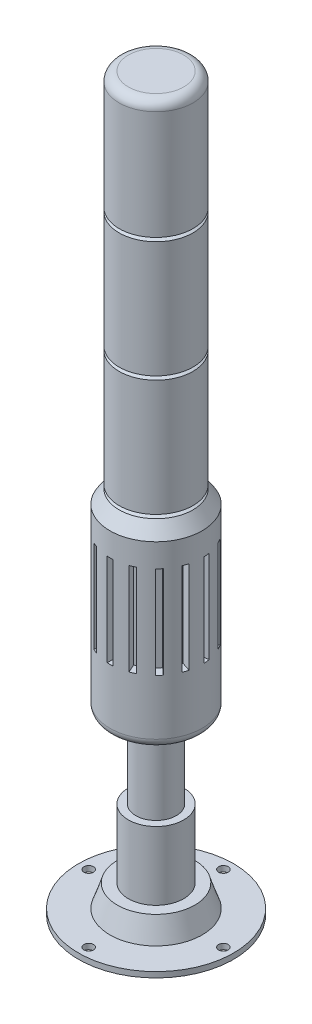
ISO-10303-21;
HEADER;
FILE_DESCRIPTION(('STEP AP214'),'2;1');
FILE_NAME('part.step','',(''),(''),'','','');
FILE_SCHEMA(('AUTOMOTIVE_DESIGN { 1 0 10303 214 1 1 1 1 }'));
ENDSEC;
DATA;
#1=APPLICATION_CONTEXT('core data for automotive mechanical design processes');
#2=APPLICATION_PROTOCOL_DEFINITION('international standard','automotive_design',2000,#1);
#3=PRODUCT_CONTEXT('',#1,'mechanical');
#4=PRODUCT('Part','Part','',(#3));
#5=PRODUCT_RELATED_PRODUCT_CATEGORY('part','',(#4));
#6=PRODUCT_DEFINITION_FORMATION('','',#4);
#7=PRODUCT_DEFINITION_CONTEXT('part definition',#1,'design');
#8=PRODUCT_DEFINITION('design','',#6,#7);
#9=PRODUCT_DEFINITION_SHAPE('','',#8);
#10=(LENGTH_UNIT() NAMED_UNIT(*) SI_UNIT(.MILLI.,.METRE.));
#11=(NAMED_UNIT(*) PLANE_ANGLE_UNIT() SI_UNIT($,.RADIAN.));
#12=(NAMED_UNIT(*) SI_UNIT($,.STERADIAN.) SOLID_ANGLE_UNIT());
#13=UNCERTAINTY_MEASURE_WITH_UNIT(LENGTH_MEASURE(1.E-05),#10,'distance_accuracy_value','');
#14=(GEOMETRIC_REPRESENTATION_CONTEXT(3) GLOBAL_UNCERTAINTY_ASSIGNED_CONTEXT((#13)) GLOBAL_UNIT_ASSIGNED_CONTEXT((#10,
#11,#12)) REPRESENTATION_CONTEXT('',''));
#15=CARTESIAN_POINT('',(0.,0.,0.));
#16=DIRECTION('',(0.,0.,1.));
#17=DIRECTION('',(1.,0.,0.));
#18=AXIS2_PLACEMENT_3D('',#15,#16,#17);
#19=CARTESIAN_POINT('',(0.,0.,0.));
#20=DIRECTION('',(0.,-1.,0.));
#21=DIRECTION('',(0.,0.,-1.));
#22=AXIS2_PLACEMENT_3D('',#19,#20,#21);
#23=CYLINDRICAL_SURFACE('',#22,25.);
#24=CARTESIAN_POINT('',(0.,180.,0.));
#25=DIRECTION('',(0.,-1.,0.));
#26=DIRECTION('',(0.,0.,-1.));
#27=AXIS2_PLACEMENT_3D('',#24,#25,#26);
#28=CIRCLE('',#27,25.);
#29=CARTESIAN_POINT('',(-19.5488448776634,180.,15.5834098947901));
#30=VERTEX_POINT('',#29);
#31=CARTESIAN_POINT('',(-17.5414530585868,180.,17.8128443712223));
#32=VERTEX_POINT('',#31);
#33=EDGE_CURVE('E954',#30,#32,#28,.F.);
#34=ORIENTED_EDGE('',*,*,#33,.T.);
#35=DIRECTION('',(0.,-1.,0.));
#36=VECTOR('',#35,1.);
#37=CARTESIAN_POINT('',(-17.5414530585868,0.,17.8128443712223));
#38=LINE('',#37,#36);
#39=CARTESIAN_POINT('',(-17.5414530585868,130.,17.8128443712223));
#40=VERTEX_POINT('',#39);
#41=EDGE_CURVE('E957',#32,#40,#38,.T.);
#42=ORIENTED_EDGE('',*,*,#41,.T.);
#43=CARTESIAN_POINT('',(0.,130.,0.));
#44=DIRECTION('',(0.,1.,0.));
#45=DIRECTION('',(0.,0.,1.));
#46=AXIS2_PLACEMENT_3D('',#43,#44,#45);
#47=CIRCLE('',#46,25.);
#48=CARTESIAN_POINT('',(-19.5488448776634,130.,15.5834098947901));
#49=VERTEX_POINT('',#48);
#50=EDGE_CURVE('E948',#40,#49,#47,.F.);
#51=ORIENTED_EDGE('',*,*,#50,.T.);
#52=DIRECTION('',(0.,-1.,0.));
#53=VECTOR('',#52,1.);
#54=CARTESIAN_POINT('',(-19.5488448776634,0.,15.5834098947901));
#55=LINE('',#54,#53);
#56=EDGE_CURVE('E951',#49,#30,#55,.F.);
#57=ORIENTED_EDGE('',*,*,#56,.T.);
#58=EDGE_LOOP('',(#34,#42,#51,#57));
#59=FACE_BOUND('',#58,.T.);
#60=CARTESIAN_POINT('',(0.,180.,0.));
#61=DIRECTION('',(0.,-1.,0.));
#62=DIRECTION('',(0.,0.,-1.));
#63=AXIS2_PLACEMENT_3D('',#60,#61,#62);
#64=CIRCLE('',#63,25.);
#65=CARTESIAN_POINT('',(-24.6614608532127,180.,-4.10028640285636));
#66=VERTEX_POINT('',#65);
#67=CARTESIAN_POINT('',(-24.9750462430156,180.,-1.11672071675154));
#68=VERTEX_POINT('',#67);
#69=EDGE_CURVE('E930',#66,#68,#64,.F.);
#70=ORIENTED_EDGE('',*,*,#69,.T.);
#71=DIRECTION('',(0.,-1.,0.));
#72=VECTOR('',#71,1.);
#73=CARTESIAN_POINT('',(-24.9750462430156,0.,-1.11672071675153));
#74=LINE('',#73,#72);
#75=CARTESIAN_POINT('',(-24.9750462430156,130.,-1.11672071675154));
#76=VERTEX_POINT('',#75);
#77=EDGE_CURVE('E933',#68,#76,#74,.T.);
#78=ORIENTED_EDGE('',*,*,#77,.T.);
#79=CARTESIAN_POINT('',(0.,130.,0.));
#80=DIRECTION('',(0.,1.,0.));
#81=DIRECTION('',(0.,0.,1.));
#82=AXIS2_PLACEMENT_3D('',#79,#80,#81);
#83=CIRCLE('',#82,25.);
#84=CARTESIAN_POINT('',(-24.6614608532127,130.,-4.10028640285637));
#85=VERTEX_POINT('',#84);
#86=EDGE_CURVE('E924',#76,#85,#83,.F.);
#87=ORIENTED_EDGE('',*,*,#86,.T.);
#88=DIRECTION('',(0.,-1.,0.));
#89=VECTOR('',#88,1.);
#90=CARTESIAN_POINT('',(-24.6614608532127,0.,-4.10028640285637));
#91=LINE('',#90,#89);
#92=EDGE_CURVE('E927',#85,#66,#91,.F.);
#93=ORIENTED_EDGE('',*,*,#92,.T.);
#94=EDGE_LOOP('',(#70,#78,#87,#93));
#95=FACE_BOUND('',#94,.T.);
#96=CARTESIAN_POINT('',(0.,180.,0.));
#97=DIRECTION('',(0.,-1.,0.));
#98=DIRECTION('',(0.,0.,-1.));
#99=AXIS2_PLACEMENT_3D('',#96,#97,#98);
#100=CIRCLE('',#99,25.);
#101=CARTESIAN_POINT('',(-13.4546316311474,180.,-21.0706641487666));
#102=VERTEX_POINT('',#101);
#103=CARTESIAN_POINT('',(-15.8816826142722,180.,-19.3073083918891));
#104=VERTEX_POINT('',#103);
#105=EDGE_CURVE('E906',#102,#104,#100,.F.);
#106=ORIENTED_EDGE('',*,*,#105,.T.);
#107=DIRECTION('',(0.,-1.,0.));
#108=VECTOR('',#107,1.);
#109=CARTESIAN_POINT('',(-15.8816826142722,0.,-19.3073083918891));
#110=LINE('',#109,#108);
#111=CARTESIAN_POINT('',(-15.8816826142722,130.,-19.3073083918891));
#112=VERTEX_POINT('',#111);
#113=EDGE_CURVE('E909',#104,#112,#110,.T.);
#114=ORIENTED_EDGE('',*,*,#113,.T.);
#115=CARTESIAN_POINT('',(0.,130.,0.));
#116=DIRECTION('',(0.,1.,0.));
#117=DIRECTION('',(0.,0.,1.));
#118=AXIS2_PLACEMENT_3D('',#115,#116,#117);
#119=CIRCLE('',#118,25.);
#120=CARTESIAN_POINT('',(-13.4546316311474,130.,-21.0706641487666));
#121=VERTEX_POINT('',#120);
#122=EDGE_CURVE('E900',#112,#121,#119,.F.);
#123=ORIENTED_EDGE('',*,*,#122,.T.);
#124=DIRECTION('',(0.,-1.,0.));
#125=VECTOR('',#124,1.);
#126=CARTESIAN_POINT('',(-13.4546316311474,0.,-21.0706641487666));
#127=LINE('',#126,#125);
#128=EDGE_CURVE('E903',#121,#102,#127,.F.);
#129=ORIENTED_EDGE('',*,*,#128,.T.);
#130=EDGE_LOOP('',(#106,#114,#123,#129));
#131=FACE_BOUND('',#130,.T.);
#132=CARTESIAN_POINT('',(0.,180.,0.));
#133=DIRECTION('',(0.,-1.,0.));
#134=DIRECTION('',(0.,0.,-1.));
#135=AXIS2_PLACEMENT_3D('',#132,#133,#134);
#136=CIRCLE('',#135,25.);
#137=CARTESIAN_POINT('',(6.65564920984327,180.,-24.0977661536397));
#138=VERTEX_POINT('',#137);
#139=CARTESIAN_POINT('',(3.72120640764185,180.,-24.721501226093));
#140=VERTEX_POINT('',#139);
#141=EDGE_CURVE('E882',#138,#140,#136,.F.);
#142=ORIENTED_EDGE('',*,*,#141,.T.);
#143=DIRECTION('',(0.,-1.,0.));
#144=VECTOR('',#143,1.);
#145=CARTESIAN_POINT('',(3.72120640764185,0.,-24.721501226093));
#146=LINE('',#145,#144);
#147=CARTESIAN_POINT('',(3.72120640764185,130.,-24.721501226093));
#148=VERTEX_POINT('',#147);
#149=EDGE_CURVE('E885',#140,#148,#146,.T.);
#150=ORIENTED_EDGE('',*,*,#149,.T.);
#151=CARTESIAN_POINT('',(0.,130.,0.));
#152=DIRECTION('',(0.,1.,0.));
#153=DIRECTION('',(0.,0.,1.));
#154=AXIS2_PLACEMENT_3D('',#151,#152,#153);
#155=CIRCLE('',#154,25.);
#156=CARTESIAN_POINT('',(6.65564920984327,130.,-24.0977661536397));
#157=VERTEX_POINT('',#156);
#158=EDGE_CURVE('E876',#148,#157,#155,.F.);
#159=ORIENTED_EDGE('',*,*,#158,.T.);
#160=DIRECTION('',(0.,-1.,0.));
#161=VECTOR('',#160,1.);
#162=CARTESIAN_POINT('',(6.65564920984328,0.,-24.0977661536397));
#163=LINE('',#162,#161);
#164=EDGE_CURVE('E879',#157,#138,#163,.F.);
#165=ORIENTED_EDGE('',*,*,#164,.T.);
#166=EDGE_LOOP('',(#142,#150,#159,#165));
#167=FACE_BOUND('',#166,.T.);
#168=CARTESIAN_POINT('',(0.,180.,0.));
#169=DIRECTION('',(0.,-1.,0.));
#170=DIRECTION('',(0.,0.,-1.));
#171=AXIS2_PLACEMENT_3D('',#168,#169,#170);
#172=CIRCLE('',#171,25.);
#173=CARTESIAN_POINT('',(22.361628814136,180.,-11.1784416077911));
#174=VERTEX_POINT('',#173);
#175=CARTESIAN_POINT('',(20.8616288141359,180.,-13.7765178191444));
#176=VERTEX_POINT('',#175);
#177=EDGE_CURVE('E858',#174,#176,#172,.F.);
#178=ORIENTED_EDGE('',*,*,#177,.T.);
#179=DIRECTION('',(0.,-1.,0.));
#180=VECTOR('',#179,1.);
#181=CARTESIAN_POINT('',(20.8616288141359,0.,-13.7765178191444));
#182=LINE('',#181,#180);
#183=CARTESIAN_POINT('',(20.8616288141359,130.,-13.7765178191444));
#184=VERTEX_POINT('',#183);
#185=EDGE_CURVE('E861',#176,#184,#182,.T.);
#186=ORIENTED_EDGE('',*,*,#185,.T.);
#187=CARTESIAN_POINT('',(0.,130.,0.));
#188=DIRECTION('',(0.,1.,0.));
#189=DIRECTION('',(0.,0.,1.));
#190=AXIS2_PLACEMENT_3D('',#187,#188,#189);
#191=CIRCLE('',#190,25.);
#192=CARTESIAN_POINT('',(22.361628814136,130.,-11.1784416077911));
#193=VERTEX_POINT('',#192);
#194=EDGE_CURVE('E852',#184,#193,#191,.F.);
#195=ORIENTED_EDGE('',*,*,#194,.T.);
#196=DIRECTION('',(0.,-1.,0.));
#197=VECTOR('',#196,1.);
#198=CARTESIAN_POINT('',(22.361628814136,0.,-11.1784416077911));
#199=LINE('',#198,#197);
#200=EDGE_CURVE('E855',#193,#174,#199,.F.);
#201=ORIENTED_EDGE('',*,*,#200,.T.);
#202=EDGE_LOOP('',(#178,#186,#195,#201));
#203=FACE_BOUND('',#202,.T.);
#204=CARTESIAN_POINT('',(0.,180.,0.));
#205=DIRECTION('',(0.,-1.,0.));
#206=DIRECTION('',(0.,0.,-1.));
#207=AXIS2_PLACEMENT_3D('',#204,#205,#206);
#208=CIRCLE('',#207,25.);
#209=CARTESIAN_POINT('',(23.2700512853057,180.,9.138091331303));
#210=VERTEX_POINT('',#209);
#211=CARTESIAN_POINT('',(24.1971022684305,180.,6.28492178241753));
#212=VERTEX_POINT('',#211);
#213=EDGE_CURVE('E834',#210,#212,#208,.F.);
#214=ORIENTED_EDGE('',*,*,#213,.T.);
#215=DIRECTION('',(0.,-1.,0.));
#216=VECTOR('',#215,1.);
#217=CARTESIAN_POINT('',(24.1971022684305,0.,6.28492178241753));
#218=LINE('',#217,#216);
#219=CARTESIAN_POINT('',(24.1971022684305,130.,6.28492178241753));
#220=VERTEX_POINT('',#219);
#221=EDGE_CURVE('E837',#212,#220,#218,.T.);
#222=ORIENTED_EDGE('',*,*,#221,.T.);
#223=CARTESIAN_POINT('',(0.,130.,0.));
#224=DIRECTION('',(0.,1.,0.));
#225=DIRECTION('',(0.,0.,1.));
#226=AXIS2_PLACEMENT_3D('',#223,#224,#225);
#227=CIRCLE('',#226,25.);
#228=CARTESIAN_POINT('',(23.2700512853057,130.,9.13809133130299));
#229=VERTEX_POINT('',#228);
#230=EDGE_CURVE('E828',#220,#229,#227,.F.);
#231=ORIENTED_EDGE('',*,*,#230,.T.);
#232=DIRECTION('',(0.,-1.,0.));
#233=VECTOR('',#232,1.);
#234=CARTESIAN_POINT('',(23.2700512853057,0.,9.138091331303));
#235=LINE('',#234,#233);
#236=EDGE_CURVE('E831',#229,#210,#235,.F.);
#237=ORIENTED_EDGE('',*,*,#236,.T.);
#238=EDGE_LOOP('',(#214,#222,#231,#237));
#239=FACE_BOUND('',#238,.T.);
#240=CARTESIAN_POINT('',(0.,180.,0.));
#241=DIRECTION('',(0.,-1.,0.));
#242=DIRECTION('',(0.,0.,-1.));
#243=AXIS2_PLACEMENT_3D('',#240,#241,#242);
#244=CIRCLE('',#243,25.);
#245=CARTESIAN_POINT('',(8.7797782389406,180.,23.4075947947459));
#246=VERTEX_POINT('',#245);
#247=CARTESIAN_POINT('',(11.5204146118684,180.,22.1873848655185));
#248=VERTEX_POINT('',#247);
#249=EDGE_CURVE('E810',#246,#248,#244,.F.);
#250=ORIENTED_EDGE('',*,*,#249,.T.);
#251=DIRECTION('',(0.,-1.,0.));
#252=VECTOR('',#251,1.);
#253=CARTESIAN_POINT('',(11.5204146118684,0.,22.1873848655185));
#254=LINE('',#253,#252);
#255=CARTESIAN_POINT('',(11.5204146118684,130.,22.1873848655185));
#256=VERTEX_POINT('',#255);
#257=EDGE_CURVE('E813',#248,#256,#254,.T.);
#258=ORIENTED_EDGE('',*,*,#257,.T.);
#259=CARTESIAN_POINT('',(0.,130.,0.));
#260=DIRECTION('',(0.,1.,0.));
#261=DIRECTION('',(0.,0.,1.));
#262=AXIS2_PLACEMENT_3D('',#259,#260,#261);
#263=CIRCLE('',#262,25.);
#264=CARTESIAN_POINT('',(8.7797782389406,130.,23.4075947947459));
#265=VERTEX_POINT('',#264);
#266=EDGE_CURVE('E804',#256,#265,#263,.F.);
#267=ORIENTED_EDGE('',*,*,#266,.T.);
#268=DIRECTION('',(0.,-1.,0.));
#269=VECTOR('',#268,1.);
#270=CARTESIAN_POINT('',(8.7797782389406,0.,23.4075947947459));
#271=LINE('',#270,#269);
#272=EDGE_CURVE('E807',#265,#246,#271,.F.);
#273=ORIENTED_EDGE('',*,*,#272,.T.);
#274=EDGE_LOOP('',(#250,#258,#267,#273));
#275=FACE_BOUND('',#274,.T.);
#276=CARTESIAN_POINT('',(0.,192.694269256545,0.));
#277=DIRECTION('',(0.,-1.,0.));
#278=DIRECTION('',(0.,0.,-1.));
#279=AXIS2_PLACEMENT_3D('',#276,#277,#278);
#280=CIRCLE('',#279,25.);
#281=CARTESIAN_POINT('',(0.,192.694269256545,-25.));
#282=VERTEX_POINT('',#281);
#283=EDGE_CURVE('E753',#282,#282,#280,.T.);
#284=ORIENTED_EDGE('',*,*,#283,.T.);
#285=EDGE_LOOP('',(#284));
#286=FACE_BOUND('',#285,.T.);
#287=CARTESIAN_POINT('',(0.,100.,0.));
#288=DIRECTION('',(0.,-1.,0.));
#289=DIRECTION('',(0.,0.,-1.));
#290=AXIS2_PLACEMENT_3D('',#287,#288,#289);
#291=CIRCLE('',#290,25.);
#292=CARTESIAN_POINT('',(0.,100.,-25.));
#293=VERTEX_POINT('',#292);
#294=EDGE_CURVE('E783',#293,#293,#291,.F.);
#295=ORIENTED_EDGE('',*,*,#294,.T.);
#296=EDGE_LOOP('',(#295));
#297=FACE_BOUND('',#296,.T.);
#298=CARTESIAN_POINT('',(0.,180.,0.));
#299=DIRECTION('',(0.,-1.,0.));
#300=DIRECTION('',(0.,0.,-1.));
#301=AXIS2_PLACEMENT_3D('',#298,#299,#300);
#302=CIRCLE('',#301,25.);
#303=CARTESIAN_POINT('',(-1.5,180.,24.9549594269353));
#304=VERTEX_POINT('',#303);
#305=CARTESIAN_POINT('',(1.5,180.,24.9549594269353));
#306=VERTEX_POINT('',#305);
#307=EDGE_CURVE('E798',#304,#306,#302,.F.);
#308=ORIENTED_EDGE('',*,*,#307,.T.);
#309=DIRECTION('',(0.,-1.,0.));
#310=VECTOR('',#309,1.);
#311=CARTESIAN_POINT('',(1.5,0.,24.9549594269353));
#312=LINE('',#311,#310);
#313=CARTESIAN_POINT('',(1.5,130.,24.9549594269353));
#314=VERTEX_POINT('',#313);
#315=EDGE_CURVE('E801',#306,#314,#312,.T.);
#316=ORIENTED_EDGE('',*,*,#315,.T.);
#317=CARTESIAN_POINT('',(0.,130.,0.));
#318=DIRECTION('',(0.,1.,0.));
#319=DIRECTION('',(0.,0.,1.));
#320=AXIS2_PLACEMENT_3D('',#317,#318,#319);
#321=CIRCLE('',#320,25.);
#322=CARTESIAN_POINT('',(-1.5,130.,24.9549594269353));
#323=VERTEX_POINT('',#322);
#324=EDGE_CURVE('E792',#314,#323,#321,.F.);
#325=ORIENTED_EDGE('',*,*,#324,.T.);
#326=DIRECTION('',(0.,-1.,0.));
#327=VECTOR('',#326,1.);
#328=CARTESIAN_POINT('',(-1.5,0.,24.9549594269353));
#329=LINE('',#328,#327);
#330=EDGE_CURVE('E795',#323,#304,#329,.F.);
#331=ORIENTED_EDGE('',*,*,#330,.T.);
#332=EDGE_LOOP('',(#308,#316,#325,#331));
#333=FACE_BOUND('',#332,.T.);
#334=CARTESIAN_POINT('',(0.,180.,0.));
#335=DIRECTION('',(0.,-1.,0.));
#336=DIRECTION('',(0.,0.,-1.));
#337=AXIS2_PLACEMENT_3D('',#334,#335,#336);
#338=CIRCLE('',#337,25.);
#339=CARTESIAN_POINT('',(17.541453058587,180.,17.8128443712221));
#340=VERTEX_POINT('',#339);
#341=CARTESIAN_POINT('',(19.5488448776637,180.,15.5834098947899));
#342=VERTEX_POINT('',#341);
#343=EDGE_CURVE('E822',#340,#342,#338,.F.);
#344=ORIENTED_EDGE('',*,*,#343,.T.);
#345=DIRECTION('',(0.,-1.,0.));
#346=VECTOR('',#345,1.);
#347=CARTESIAN_POINT('',(19.5488448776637,0.,15.5834098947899));
#348=LINE('',#347,#346);
#349=CARTESIAN_POINT('',(19.5488448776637,130.,15.5834098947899));
#350=VERTEX_POINT('',#349);
#351=EDGE_CURVE('E825',#342,#350,#348,.T.);
#352=ORIENTED_EDGE('',*,*,#351,.T.);
#353=CARTESIAN_POINT('',(0.,130.,0.));
#354=DIRECTION('',(0.,1.,0.));
#355=DIRECTION('',(0.,0.,1.));
#356=AXIS2_PLACEMENT_3D('',#353,#354,#355);
#357=CIRCLE('',#356,25.);
#358=CARTESIAN_POINT('',(17.541453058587,130.,17.8128443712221));
#359=VERTEX_POINT('',#358);
#360=EDGE_CURVE('E816',#350,#359,#357,.F.);
#361=ORIENTED_EDGE('',*,*,#360,.T.);
#362=DIRECTION('',(0.,-1.,0.));
#363=VECTOR('',#362,1.);
#364=CARTESIAN_POINT('',(17.541453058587,0.,17.8128443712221));
#365=LINE('',#364,#363);
#366=EDGE_CURVE('E819',#359,#340,#365,.F.);
#367=ORIENTED_EDGE('',*,*,#366,.T.);
#368=EDGE_LOOP('',(#344,#352,#361,#367));
#369=FACE_BOUND('',#368,.T.);
#370=CARTESIAN_POINT('',(0.,180.,0.));
#371=DIRECTION('',(0.,-1.,0.));
#372=DIRECTION('',(0.,0.,-1.));
#373=AXIS2_PLACEMENT_3D('',#370,#371,#372);
#374=CIRCLE('',#373,25.);
#375=CARTESIAN_POINT('',(24.9750462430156,180.,-1.11672071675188));
#376=VERTEX_POINT('',#375);
#377=CARTESIAN_POINT('',(24.6614608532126,180.,-4.1002864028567));
#378=VERTEX_POINT('',#377);
#379=EDGE_CURVE('E846',#376,#378,#374,.F.);
#380=ORIENTED_EDGE('',*,*,#379,.T.);
#381=DIRECTION('',(0.,-1.,0.));
#382=VECTOR('',#381,1.);
#383=CARTESIAN_POINT('',(24.6614608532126,0.,-4.1002864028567));
#384=LINE('',#383,#382);
#385=CARTESIAN_POINT('',(24.6614608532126,130.,-4.1002864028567));
#386=VERTEX_POINT('',#385);
#387=EDGE_CURVE('E849',#378,#386,#384,.T.);
#388=ORIENTED_EDGE('',*,*,#387,.T.);
#389=CARTESIAN_POINT('',(0.,130.,0.));
#390=DIRECTION('',(0.,1.,0.));
#391=DIRECTION('',(0.,0.,1.));
#392=AXIS2_PLACEMENT_3D('',#389,#390,#391);
#393=CIRCLE('',#392,25.);
#394=CARTESIAN_POINT('',(24.9750462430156,130.,-1.11672071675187));
#395=VERTEX_POINT('',#394);
#396=EDGE_CURVE('E840',#386,#395,#393,.F.);
#397=ORIENTED_EDGE('',*,*,#396,.T.);
#398=DIRECTION('',(0.,-1.,0.));
#399=VECTOR('',#398,1.);
#400=CARTESIAN_POINT('',(24.9750462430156,0.,-1.11672071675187));
#401=LINE('',#400,#399);
#402=EDGE_CURVE('E843',#395,#376,#401,.F.);
#403=ORIENTED_EDGE('',*,*,#402,.T.);
#404=EDGE_LOOP('',(#380,#388,#397,#403));
#405=FACE_BOUND('',#404,.T.);
#406=CARTESIAN_POINT('',(0.,180.,0.));
#407=DIRECTION('',(0.,-1.,0.));
#408=DIRECTION('',(0.,0.,-1.));
#409=AXIS2_PLACEMENT_3D('',#406,#407,#408);
#410=CIRCLE('',#409,25.);
#411=CARTESIAN_POINT('',(15.881682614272,180.,-19.3073083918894));
#412=VERTEX_POINT('',#411);
#413=CARTESIAN_POINT('',(13.4546316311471,180.,-21.0706641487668));
#414=VERTEX_POINT('',#413);
#415=EDGE_CURVE('E870',#412,#414,#410,.F.);
#416=ORIENTED_EDGE('',*,*,#415,.T.);
#417=DIRECTION('',(0.,-1.,0.));
#418=VECTOR('',#417,1.);
#419=CARTESIAN_POINT('',(13.4546316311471,0.,-21.0706641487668));
#420=LINE('',#419,#418);
#421=CARTESIAN_POINT('',(13.4546316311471,130.,-21.0706641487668));
#422=VERTEX_POINT('',#421);
#423=EDGE_CURVE('E873',#414,#422,#420,.T.);
#424=ORIENTED_EDGE('',*,*,#423,.T.);
#425=CARTESIAN_POINT('',(0.,130.,0.));
#426=DIRECTION('',(0.,1.,0.));
#427=DIRECTION('',(0.,0.,1.));
#428=AXIS2_PLACEMENT_3D('',#425,#426,#427);
#429=CIRCLE('',#428,25.);
#430=CARTESIAN_POINT('',(15.881682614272,130.,-19.3073083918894));
#431=VERTEX_POINT('',#430);
#432=EDGE_CURVE('E864',#422,#431,#429,.F.);
#433=ORIENTED_EDGE('',*,*,#432,.T.);
#434=DIRECTION('',(0.,-1.,0.));
#435=VECTOR('',#434,1.);
#436=CARTESIAN_POINT('',(15.881682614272,0.,-19.3073083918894));
#437=LINE('',#436,#435);
#438=EDGE_CURVE('E867',#431,#412,#437,.F.);
#439=ORIENTED_EDGE('',*,*,#438,.T.);
#440=EDGE_LOOP('',(#416,#424,#433,#439));
#441=FACE_BOUND('',#440,.T.);
#442=CARTESIAN_POINT('',(0.,180.,0.));
#443=DIRECTION('',(0.,-1.,0.));
#444=DIRECTION('',(0.,0.,-1.));
#445=AXIS2_PLACEMENT_3D('',#442,#443,#444);
#446=CIRCLE('',#445,25.);
#447=CARTESIAN_POINT('',(-3.72120640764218,180.,-24.7215012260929));
#448=VERTEX_POINT('',#447);
#449=CARTESIAN_POINT('',(-6.6556492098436,180.,-24.0977661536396));
#450=VERTEX_POINT('',#449);
#451=EDGE_CURVE('E894',#448,#450,#446,.F.);
#452=ORIENTED_EDGE('',*,*,#451,.T.);
#453=DIRECTION('',(0.,-1.,0.));
#454=VECTOR('',#453,1.);
#455=CARTESIAN_POINT('',(-6.6556492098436,0.,-24.0977661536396));
#456=LINE('',#455,#454);
#457=CARTESIAN_POINT('',(-6.6556492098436,130.,-24.0977661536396));
#458=VERTEX_POINT('',#457);
#459=EDGE_CURVE('E897',#450,#458,#456,.T.);
#460=ORIENTED_EDGE('',*,*,#459,.T.);
#461=CARTESIAN_POINT('',(0.,130.,0.));
#462=DIRECTION('',(0.,1.,0.));
#463=DIRECTION('',(0.,0.,1.));
#464=AXIS2_PLACEMENT_3D('',#461,#462,#463);
#465=CIRCLE('',#464,25.);
#466=CARTESIAN_POINT('',(-3.72120640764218,130.,-24.7215012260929));
#467=VERTEX_POINT('',#466);
#468=EDGE_CURVE('E888',#458,#467,#465,.F.);
#469=ORIENTED_EDGE('',*,*,#468,.T.);
#470=DIRECTION('',(0.,-1.,0.));
#471=VECTOR('',#470,1.);
#472=CARTESIAN_POINT('',(-3.72120640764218,0.,-24.7215012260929));
#473=LINE('',#472,#471);
#474=EDGE_CURVE('E891',#467,#448,#473,.F.);
#475=ORIENTED_EDGE('',*,*,#474,.T.);
#476=EDGE_LOOP('',(#452,#460,#469,#475));
#477=FACE_BOUND('',#476,.T.);
#478=CARTESIAN_POINT('',(0.,180.,0.));
#479=DIRECTION('',(0.,-1.,0.));
#480=DIRECTION('',(0.,0.,-1.));
#481=AXIS2_PLACEMENT_3D('',#478,#479,#480);
#482=CIRCLE('',#481,25.);
#483=CARTESIAN_POINT('',(-20.8616288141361,180.,-13.7765178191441));
#484=VERTEX_POINT('',#483);
#485=CARTESIAN_POINT('',(-22.3616288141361,180.,-11.1784416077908));
#486=VERTEX_POINT('',#485);
#487=EDGE_CURVE('E918',#484,#486,#482,.F.);
#488=ORIENTED_EDGE('',*,*,#487,.T.);
#489=DIRECTION('',(0.,-1.,0.));
#490=VECTOR('',#489,1.);
#491=CARTESIAN_POINT('',(-22.3616288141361,0.,-11.1784416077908));
#492=LINE('',#491,#490);
#493=CARTESIAN_POINT('',(-22.3616288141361,130.,-11.1784416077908));
#494=VERTEX_POINT('',#493);
#495=EDGE_CURVE('E921',#486,#494,#492,.T.);
#496=ORIENTED_EDGE('',*,*,#495,.T.);
#497=CARTESIAN_POINT('',(0.,130.,0.));
#498=DIRECTION('',(0.,1.,0.));
#499=DIRECTION('',(0.,0.,1.));
#500=AXIS2_PLACEMENT_3D('',#497,#498,#499);
#501=CIRCLE('',#500,25.);
#502=CARTESIAN_POINT('',(-20.8616288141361,130.,-13.7765178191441));
#503=VERTEX_POINT('',#502);
#504=EDGE_CURVE('E912',#494,#503,#501,.F.);
#505=ORIENTED_EDGE('',*,*,#504,.T.);
#506=DIRECTION('',(0.,-1.,0.));
#507=VECTOR('',#506,1.);
#508=CARTESIAN_POINT('',(-20.8616288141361,0.,-13.7765178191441));
#509=LINE('',#508,#507);
#510=EDGE_CURVE('E915',#503,#484,#509,.F.);
#511=ORIENTED_EDGE('',*,*,#510,.T.);
#512=EDGE_LOOP('',(#488,#496,#505,#511));
#513=FACE_BOUND('',#512,.T.);
#514=CARTESIAN_POINT('',(0.,180.,0.));
#515=DIRECTION('',(0.,-1.,0.));
#516=DIRECTION('',(0.,0.,-1.));
#517=AXIS2_PLACEMENT_3D('',#514,#515,#516);
#518=CIRCLE('',#517,25.);
#519=CARTESIAN_POINT('',(-24.1971022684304,180.,6.28492178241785));
#520=VERTEX_POINT('',#519);
#521=CARTESIAN_POINT('',(-23.2700512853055,180.,9.1380913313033));
#522=VERTEX_POINT('',#521);
#523=EDGE_CURVE('E942',#520,#522,#518,.F.);
#524=ORIENTED_EDGE('',*,*,#523,.T.);
#525=DIRECTION('',(0.,-1.,0.));
#526=VECTOR('',#525,1.);
#527=CARTESIAN_POINT('',(-23.2700512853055,0.,9.1380913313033));
#528=LINE('',#527,#526);
#529=CARTESIAN_POINT('',(-23.2700512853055,130.,9.1380913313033));
#530=VERTEX_POINT('',#529);
#531=EDGE_CURVE('E945',#522,#530,#528,.T.);
#532=ORIENTED_EDGE('',*,*,#531,.T.);
#533=CARTESIAN_POINT('',(0.,130.,0.));
#534=DIRECTION('',(0.,1.,0.));
#535=DIRECTION('',(0.,0.,1.));
#536=AXIS2_PLACEMENT_3D('',#533,#534,#535);
#537=CIRCLE('',#536,25.);
#538=CARTESIAN_POINT('',(-24.1971022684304,130.,6.28492178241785));
#539=VERTEX_POINT('',#538);
#540=EDGE_CURVE('E936',#530,#539,#537,.F.);
#541=ORIENTED_EDGE('',*,*,#540,.T.);
#542=DIRECTION('',(0.,-1.,0.));
#543=VECTOR('',#542,1.);
#544=CARTESIAN_POINT('',(-24.1971022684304,0.,6.28492178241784));
#545=LINE('',#544,#543);
#546=EDGE_CURVE('E939',#539,#520,#545,.F.);
#547=ORIENTED_EDGE('',*,*,#546,.T.);
#548=EDGE_LOOP('',(#524,#532,#541,#547));
#549=FACE_BOUND('',#548,.T.);
#550=CARTESIAN_POINT('',(0.,180.,0.));
#551=DIRECTION('',(0.,-1.,0.));
#552=DIRECTION('',(0.,0.,-1.));
#553=AXIS2_PLACEMENT_3D('',#550,#551,#552);
#554=CIRCLE('',#553,25.);
#555=CARTESIAN_POINT('',(-11.5204146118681,180.,22.1873848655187));
#556=VERTEX_POINT('',#555);
#557=CARTESIAN_POINT('',(-8.77977823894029,180.,23.407594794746));
#558=VERTEX_POINT('',#557);
#559=EDGE_CURVE('E24',#556,#558,#554,.F.);
#560=ORIENTED_EDGE('',*,*,#559,.T.);
#561=DIRECTION('',(0.,-1.,0.));
#562=VECTOR('',#561,1.);
#563=CARTESIAN_POINT('',(-8.77977823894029,0.,23.407594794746));
#564=LINE('',#563,#562);
#565=CARTESIAN_POINT('',(-8.77977823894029,130.,23.407594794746));
#566=VERTEX_POINT('',#565);
#567=EDGE_CURVE('E11',#558,#566,#564,.T.);
#568=ORIENTED_EDGE('',*,*,#567,.T.);
#569=CARTESIAN_POINT('',(0.,130.,0.));
#570=DIRECTION('',(0.,1.,0.));
#571=DIRECTION('',(0.,0.,1.));
#572=AXIS2_PLACEMENT_3D('',#569,#570,#571);
#573=CIRCLE('',#572,25.);
#574=CARTESIAN_POINT('',(-11.5204146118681,130.,22.1873848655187));
#575=VERTEX_POINT('',#574);
#576=EDGE_CURVE('E960',#566,#575,#573,.F.);
#577=ORIENTED_EDGE('',*,*,#576,.T.);
#578=DIRECTION('',(0.,-1.,0.));
#579=VECTOR('',#578,1.);
#580=CARTESIAN_POINT('',(-11.5204146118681,0.,22.1873848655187));
#581=LINE('',#580,#579);
#582=EDGE_CURVE('E963',#575,#556,#581,.F.);
#583=ORIENTED_EDGE('',*,*,#582,.T.);
#584=EDGE_LOOP('',(#560,#568,#577,#583));
#585=FACE_BOUND('',#584,.T.);
#586=ADVANCED_FACE('F16',(#59,#95,#131,#167,#203,#239,#275,#286,#297,#333,#369,#405,#441,#477,
#513,#549,#585),#23,.T.);
#587=CARTESIAN_POINT('',(0.,0.,0.));
#588=DIRECTION('',(0.,-1.,0.));
#589=DIRECTION('',(0.,0.,-1.));
#590=AXIS2_PLACEMENT_3D('',#587,#588,#589);
#591=PLANE('',#590);
#592=CARTESIAN_POINT('',(3.82317428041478E-13,0.,36.5));
#593=DIRECTION('',(0.,1.,0.));
#594=DIRECTION('',(-1.,0.,0.));
#595=AXIS2_PLACEMENT_3D('',#592,#593,#594);
#596=CIRCLE('',#595,2.6);
#597=CARTESIAN_POINT('',(-2.59999999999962,0.,36.5));
#598=VERTEX_POINT('',#597);
#599=EDGE_CURVE('E705',#598,#598,#596,.T.);
#600=ORIENTED_EDGE('',*,*,#599,.T.);
#601=EDGE_LOOP('',(#600));
#602=FACE_BOUND('',#601,.T.);
#603=CARTESIAN_POINT('',(-36.5,0.,2.54878285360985E-13));
#604=DIRECTION('',(0.,1.,0.));
#605=DIRECTION('',(0.,0.,-1.));
#606=AXIS2_PLACEMENT_3D('',#603,#604,#605);
#607=CIRCLE('',#606,2.6);
#608=CARTESIAN_POINT('',(-36.5,0.,-2.59999999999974));
#609=VERTEX_POINT('',#608);
#610=EDGE_CURVE('E711',#609,#609,#607,.T.);
#611=ORIENTED_EDGE('',*,*,#610,.T.);
#612=EDGE_LOOP('',(#611));
#613=FACE_BOUND('',#612,.T.);
#614=CARTESIAN_POINT('',(-1.27439142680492E-13,0.,-36.5));
#615=DIRECTION('',(0.,1.,0.));
#616=DIRECTION('',(1.,0.,0.));
#617=AXIS2_PLACEMENT_3D('',#614,#615,#616);
#618=CIRCLE('',#617,2.6);
#619=CARTESIAN_POINT('',(2.59999999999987,0.,-36.5));
#620=VERTEX_POINT('',#619);
#621=EDGE_CURVE('E717',#620,#620,#618,.T.);
#622=ORIENTED_EDGE('',*,*,#621,.T.);
#623=EDGE_LOOP('',(#622));
#624=FACE_BOUND('',#623,.T.);
#625=CARTESIAN_POINT('',(36.5,0.,0.));
#626=DIRECTION('',(0.,1.,0.));
#627=DIRECTION('',(0.,0.,1.));
#628=AXIS2_PLACEMENT_3D('',#625,#626,#627);
#629=CIRCLE('',#628,2.6);
#630=CARTESIAN_POINT('',(36.5,0.,2.6));
#631=VERTEX_POINT('',#630);
#632=EDGE_CURVE('E723',#631,#631,#629,.T.);
#633=ORIENTED_EDGE('',*,*,#632,.T.);
#634=EDGE_LOOP('',(#633));
#635=FACE_BOUND('',#634,.T.);
#636=CARTESIAN_POINT('',(0.,0.,0.));
#637=DIRECTION('',(0.,-1.,0.));
#638=DIRECTION('',(0.,0.,-1.));
#639=AXIS2_PLACEMENT_3D('',#636,#637,#638);
#640=CIRCLE('',#639,42.);
#641=CARTESIAN_POINT('',(0.,0.,-42.));
#642=VERTEX_POINT('',#641);
#643=EDGE_CURVE('E777',#642,#642,#640,.T.);
#644=ORIENTED_EDGE('',*,*,#643,.T.);
#645=EDGE_LOOP('',(#644));
#646=FACE_BOUND('',#645,.T.);
#647=ADVANCED_FACE('F18',(#602,#613,#624,#635,#646),#591,.T.);
#648=CARTESIAN_POINT('',(0.,0.,0.));
#649=DIRECTION('',(0.,-1.,0.));
#650=DIRECTION('',(0.,0.,-1.));
#651=AXIS2_PLACEMENT_3D('',#648,#649,#650);
#652=CYLINDRICAL_SURFACE('',#651,42.);
#653=CARTESIAN_POINT('',(0.,3.,0.));
#654=DIRECTION('',(0.,-1.,0.));
#655=DIRECTION('',(0.,0.,-1.));
#656=AXIS2_PLACEMENT_3D('',#653,#654,#655);
#657=CIRCLE('',#656,42.);
#658=CARTESIAN_POINT('',(0.,3.,-42.));
#659=VERTEX_POINT('',#658);
#660=EDGE_CURVE('E774',#659,#659,#657,.T.);
#661=ORIENTED_EDGE('',*,*,#660,.T.);
#662=EDGE_LOOP('',(#661));
#663=FACE_BOUND('',#662,.T.);
#664=ORIENTED_EDGE('',*,*,#643,.F.);
#665=EDGE_LOOP('',(#664));
#666=FACE_BOUND('',#665,.T.);
#667=ADVANCED_FACE('F987',(#663,#666),#652,.T.);
#668=CARTESIAN_POINT('',(42.,3.,0.));
#669=DIRECTION('',(0.,1.,0.));
#670=DIRECTION('',(0.,0.,1.));
#671=AXIS2_PLACEMENT_3D('',#668,#669,#670);
#672=PLANE('',#671);
#673=CARTESIAN_POINT('',(3.82317428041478E-13,3.,36.5));
#674=DIRECTION('',(0.,1.,0.));
#675=DIRECTION('',(-1.,0.,0.));
#676=AXIS2_PLACEMENT_3D('',#673,#674,#675);
#677=CIRCLE('',#676,2.6);
#678=CARTESIAN_POINT('',(-2.59999999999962,3.,36.5));
#679=VERTEX_POINT('',#678);
#680=EDGE_CURVE('E702',#679,#679,#677,.T.);
#681=ORIENTED_EDGE('',*,*,#680,.F.);
#682=EDGE_LOOP('',(#681));
#683=FACE_BOUND('',#682,.T.);
#684=CARTESIAN_POINT('',(-36.5,3.,2.54878285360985E-13));
#685=DIRECTION('',(0.,1.,0.));
#686=DIRECTION('',(0.,0.,-1.));
#687=AXIS2_PLACEMENT_3D('',#684,#685,#686);
#688=CIRCLE('',#687,2.6);
#689=CARTESIAN_POINT('',(-36.5,3.,-2.59999999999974));
#690=VERTEX_POINT('',#689);
#691=EDGE_CURVE('E708',#690,#690,#688,.T.);
#692=ORIENTED_EDGE('',*,*,#691,.F.);
#693=EDGE_LOOP('',(#692));
#694=FACE_BOUND('',#693,.T.);
#695=CARTESIAN_POINT('',(-1.27439142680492E-13,3.,-36.5));
#696=DIRECTION('',(0.,1.,0.));
#697=DIRECTION('',(1.,0.,0.));
#698=AXIS2_PLACEMENT_3D('',#695,#696,#697);
#699=CIRCLE('',#698,2.6);
#700=CARTESIAN_POINT('',(2.59999999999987,3.,-36.5));
#701=VERTEX_POINT('',#700);
#702=EDGE_CURVE('E714',#701,#701,#699,.T.);
#703=ORIENTED_EDGE('',*,*,#702,.F.);
#704=EDGE_LOOP('',(#703));
#705=FACE_BOUND('',#704,.T.);
#706=CARTESIAN_POINT('',(36.5,3.,0.));
#707=DIRECTION('',(0.,1.,0.));
#708=DIRECTION('',(0.,0.,1.));
#709=AXIS2_PLACEMENT_3D('',#706,#707,#708);
#710=CIRCLE('',#709,2.6);
#711=CARTESIAN_POINT('',(36.5,3.,2.6));
#712=VERTEX_POINT('',#711);
#713=EDGE_CURVE('E720',#712,#712,#710,.T.);
#714=ORIENTED_EDGE('',*,*,#713,.F.);
#715=EDGE_LOOP('',(#714));
#716=FACE_BOUND('',#715,.T.);
#717=CARTESIAN_POINT('',(0.,3.,0.));
#718=DIRECTION('',(0.,-1.,0.));
#719=DIRECTION('',(0.,0.,-1.));
#720=AXIS2_PLACEMENT_3D('',#717,#718,#719);
#721=CIRCLE('',#720,25.);
#722=CARTESIAN_POINT('',(0.,3.,-25.));
#723=VERTEX_POINT('',#722);
#724=EDGE_CURVE('E771',#723,#723,#721,.T.);
#725=ORIENTED_EDGE('',*,*,#724,.T.);
#726=EDGE_LOOP('',(#725));
#727=FACE_BOUND('',#726,.T.);
#728=ORIENTED_EDGE('',*,*,#660,.F.);
#729=EDGE_LOOP('',(#728));
#730=FACE_BOUND('',#729,.T.);
#731=ADVANCED_FACE('F1017',(#683,#694,#705,#716,#727,#730),#672,.T.);
#732=CARTESIAN_POINT('',(0.,3.,0.));
#733=DIRECTION('',(0.,-1.,0.));
#734=DIRECTION('',(0.,0.,-1.));
#735=AXIS2_PLACEMENT_3D('',#732,#733,#734);
#736=CONICAL_SURFACE('',#735,25.,0.321750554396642);
#737=CARTESIAN_POINT('',(0.,15.,0.));
#738=DIRECTION('',(0.,-1.,0.));
#739=DIRECTION('',(0.,0.,-1.));
#740=AXIS2_PLACEMENT_3D('',#737,#738,#739);
#741=CIRCLE('',#740,21.);
#742=CARTESIAN_POINT('',(0.,15.,-21.));
#743=VERTEX_POINT('',#742);
#744=EDGE_CURVE('E768',#743,#743,#741,.T.);
#745=ORIENTED_EDGE('',*,*,#744,.T.);
#746=EDGE_LOOP('',(#745));
#747=FACE_BOUND('',#746,.T.);
#748=ORIENTED_EDGE('',*,*,#724,.F.);
#749=EDGE_LOOP('',(#748));
#750=FACE_BOUND('',#749,.T.);
#751=ADVANCED_FACE('F1013',(#747,#750),#736,.T.);
#752=CARTESIAN_POINT('',(21.,15.,0.));
#753=DIRECTION('',(0.,1.,0.));
#754=DIRECTION('',(0.,0.,1.));
#755=AXIS2_PLACEMENT_3D('',#752,#753,#754);
#756=PLANE('',#755);
#757=CARTESIAN_POINT('',(0.,15.,0.));
#758=DIRECTION('',(0.,-1.,0.));
#759=DIRECTION('',(0.,0.,-1.));
#760=AXIS2_PLACEMENT_3D('',#757,#758,#759);
#761=CIRCLE('',#760,15.);
#762=CARTESIAN_POINT('',(0.,15.,-15.));
#763=VERTEX_POINT('',#762);
#764=EDGE_CURVE('E765',#763,#763,#761,.T.);
#765=ORIENTED_EDGE('',*,*,#764,.T.);
#766=EDGE_LOOP('',(#765));
#767=FACE_BOUND('',#766,.T.);
#768=ORIENTED_EDGE('',*,*,#744,.F.);
#769=EDGE_LOOP('',(#768));
#770=FACE_BOUND('',#769,.T.);
#771=ADVANCED_FACE('F1009',(#767,#770),#756,.T.);
#772=CARTESIAN_POINT('',(0.,0.,0.));
#773=DIRECTION('',(0.,-1.,0.));
#774=DIRECTION('',(0.,0.,-1.));
#775=AXIS2_PLACEMENT_3D('',#772,#773,#774);
#776=CYLINDRICAL_SURFACE('',#775,15.);
#777=CARTESIAN_POINT('',(0.,52.,0.));
#778=DIRECTION('',(0.,-1.,0.));
#779=DIRECTION('',(0.,0.,-1.));
#780=AXIS2_PLACEMENT_3D('',#777,#778,#779);
#781=CIRCLE('',#780,15.);
#782=CARTESIAN_POINT('',(0.,52.,-15.));
#783=VERTEX_POINT('',#782);
#784=EDGE_CURVE('E762',#783,#783,#781,.T.);
#785=ORIENTED_EDGE('',*,*,#784,.T.);
#786=EDGE_LOOP('',(#785));
#787=FACE_BOUND('',#786,.T.);
#788=ORIENTED_EDGE('',*,*,#764,.F.);
#789=EDGE_LOOP('',(#788));
#790=FACE_BOUND('',#789,.T.);
#791=ADVANCED_FACE('F1005',(#787,#790),#776,.T.);
#792=CARTESIAN_POINT('',(15.,52.,0.));
#793=DIRECTION('',(0.,1.,0.));
#794=DIRECTION('',(0.,0.,1.));
#795=AXIS2_PLACEMENT_3D('',#792,#793,#794);
#796=PLANE('',#795);
#797=CARTESIAN_POINT('',(0.,52.,0.));
#798=DIRECTION('',(0.,-1.,0.));
#799=DIRECTION('',(0.,0.,-1.));
#800=AXIS2_PLACEMENT_3D('',#797,#798,#799);
#801=CIRCLE('',#800,11.);
#802=CARTESIAN_POINT('',(0.,52.,-11.));
#803=VERTEX_POINT('',#802);
#804=EDGE_CURVE('E759',#803,#803,#801,.T.);
#805=ORIENTED_EDGE('',*,*,#804,.T.);
#806=EDGE_LOOP('',(#805));
#807=FACE_BOUND('',#806,.T.);
#808=ORIENTED_EDGE('',*,*,#784,.F.);
#809=EDGE_LOOP('',(#808));
#810=FACE_BOUND('',#809,.T.);
#811=ADVANCED_FACE('F1001',(#807,#810),#796,.T.);
#812=CARTESIAN_POINT('',(0.,0.,0.));
#813=DIRECTION('',(0.,-1.,0.));
#814=DIRECTION('',(0.,0.,-1.));
#815=AXIS2_PLACEMENT_3D('',#812,#813,#814);
#816=CYLINDRICAL_SURFACE('',#815,11.);
#817=CARTESIAN_POINT('',(0.,95.,0.));
#818=DIRECTION('',(0.,-1.,0.));
#819=DIRECTION('',(0.,0.,-1.));
#820=AXIS2_PLACEMENT_3D('',#817,#818,#819);
#821=CIRCLE('',#820,11.);
#822=CARTESIAN_POINT('',(0.,95.,-11.));
#823=VERTEX_POINT('',#822);
#824=EDGE_CURVE('E756',#823,#823,#821,.T.);
#825=ORIENTED_EDGE('',*,*,#824,.T.);
#826=EDGE_LOOP('',(#825));
#827=FACE_BOUND('',#826,.T.);
#828=ORIENTED_EDGE('',*,*,#804,.F.);
#829=EDGE_LOOP('',(#828));
#830=FACE_BOUND('',#829,.T.);
#831=ADVANCED_FACE('F997',(#827,#830),#816,.T.);
#832=CARTESIAN_POINT('',(11.,95.,0.));
#833=DIRECTION('',(0.,-1.,0.));
#834=DIRECTION('',(0.,0.,-1.));
#835=AXIS2_PLACEMENT_3D('',#832,#833,#834);
#836=PLANE('',#835);
#837=CARTESIAN_POINT('',(0.,95.,0.));
#838=DIRECTION('',(0.,-1.,0.));
#839=DIRECTION('',(0.,0.,-1.));
#840=AXIS2_PLACEMENT_3D('',#837,#838,#839);
#841=CIRCLE('',#840,20.);
#842=CARTESIAN_POINT('',(0.,95.,-20.));
#843=VERTEX_POINT('',#842);
#844=EDGE_CURVE('E780',#843,#843,#841,.T.);
#845=ORIENTED_EDGE('',*,*,#844,.T.);
#846=EDGE_LOOP('',(#845));
#847=FACE_BOUND('',#846,.T.);
#848=ORIENTED_EDGE('',*,*,#824,.F.);
#849=EDGE_LOOP('',(#848));
#850=FACE_BOUND('',#849,.T.);
#851=ADVANCED_FACE('F994',(#847,#850),#836,.T.);
#852=CARTESIAN_POINT('',(0.,192.694269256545,0.));
#853=DIRECTION('',(0.,-1.,0.));
#854=DIRECTION('',(0.,0.,-1.));
#855=AXIS2_PLACEMENT_3D('',#852,#853,#854);
#856=CONICAL_SURFACE('',#855,25.,0.600175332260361);
#857=CARTESIAN_POINT('',(0.,200.,0.));
#858=DIRECTION('',(0.,-1.,0.));
#859=DIRECTION('',(0.,0.,-1.));
#860=AXIS2_PLACEMENT_3D('',#857,#858,#859);
#861=CIRCLE('',#860,20.);
#862=CARTESIAN_POINT('',(0.,200.,-20.));
#863=VERTEX_POINT('',#862);
#864=EDGE_CURVE('E750',#863,#863,#861,.T.);
#865=ORIENTED_EDGE('',*,*,#864,.T.);
#866=EDGE_LOOP('',(#865));
#867=FACE_BOUND('',#866,.T.);
#868=ORIENTED_EDGE('',*,*,#283,.F.);
#869=EDGE_LOOP('',(#868));
#870=FACE_BOUND('',#869,.T.);
#871=ADVANCED_FACE('F992',(#867,#870),#856,.T.);
#872=CARTESIAN_POINT('',(0.,200.,0.));
#873=DIRECTION('',(0.,-1.,0.));
#874=DIRECTION('',(0.,0.,-1.));
#875=AXIS2_PLACEMENT_3D('',#872,#873,#874);
#876=CONICAL_SURFACE('',#875,20.,1.1071487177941);
#877=CARTESIAN_POINT('',(0.,201.,0.));
#878=DIRECTION('',(0.,-1.,0.));
#879=DIRECTION('',(0.,0.,-1.));
#880=AXIS2_PLACEMENT_3D('',#877,#878,#879);
#881=CIRCLE('',#880,18.);
#882=CARTESIAN_POINT('',(0.,201.,-18.));
#883=VERTEX_POINT('',#882);
#884=EDGE_CURVE('E747',#883,#883,#881,.T.);
#885=ORIENTED_EDGE('',*,*,#884,.T.);
#886=EDGE_LOOP('',(#885));
#887=FACE_BOUND('',#886,.T.);
#888=ORIENTED_EDGE('',*,*,#864,.F.);
#889=EDGE_LOOP('',(#888));
#890=FACE_BOUND('',#889,.T.);
#891=ADVANCED_FACE('F1868',(#887,#890),#876,.T.);
#892=CARTESIAN_POINT('',(0.,201.,0.));
#893=DIRECTION('',(0.,1.,0.));
#894=DIRECTION('',(0.,0.,1.));
#895=AXIS2_PLACEMENT_3D('',#892,#893,#894);
#896=CONICAL_SURFACE('',#895,18.,1.1071487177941);
#897=CARTESIAN_POINT('',(0.,202.,0.));
#898=DIRECTION('',(0.,-1.,0.));
#899=DIRECTION('',(0.,0.,-1.));
#900=AXIS2_PLACEMENT_3D('',#897,#898,#899);
#901=CIRCLE('',#900,20.);
#902=CARTESIAN_POINT('',(0.,202.,-20.));
#903=VERTEX_POINT('',#902);
#904=EDGE_CURVE('E744',#903,#903,#901,.T.);
#905=ORIENTED_EDGE('',*,*,#904,.T.);
#906=EDGE_LOOP('',(#905));
#907=FACE_BOUND('',#906,.T.);
#908=ORIENTED_EDGE('',*,*,#884,.F.);
#909=EDGE_LOOP('',(#908));
#910=FACE_BOUND('',#909,.T.);
#911=ADVANCED_FACE('F1074',(#907,#910),#896,.T.);
#912=CARTESIAN_POINT('',(0.,0.,0.));
#913=DIRECTION('',(0.,-1.,0.));
#914=DIRECTION('',(0.,0.,-1.));
#915=AXIS2_PLACEMENT_3D('',#912,#913,#914);
#916=CYLINDRICAL_SURFACE('',#915,20.);
#917=CARTESIAN_POINT('',(0.,265.,0.));
#918=DIRECTION('',(0.,-1.,0.));
#919=DIRECTION('',(0.,0.,-1.));
#920=AXIS2_PLACEMENT_3D('',#917,#918,#919);
#921=CIRCLE('',#920,20.);
#922=CARTESIAN_POINT('',(0.,265.,-20.));
#923=VERTEX_POINT('',#922);
#924=EDGE_CURVE('E741',#923,#923,#921,.T.);
#925=ORIENTED_EDGE('',*,*,#924,.T.);
#926=EDGE_LOOP('',(#925));
#927=FACE_BOUND('',#926,.T.);
#928=ORIENTED_EDGE('',*,*,#904,.F.);
#929=EDGE_LOOP('',(#928));
#930=FACE_BOUND('',#929,.T.);
#931=ADVANCED_FACE('F1069',(#927,#930),#916,.T.);
#932=CARTESIAN_POINT('',(0.,265.,0.));
#933=DIRECTION('',(0.,-1.,0.));
#934=DIRECTION('',(0.,0.,-1.));
#935=AXIS2_PLACEMENT_3D('',#932,#933,#934);
#936=CONICAL_SURFACE('',#935,20.,1.10714871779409);
#937=CARTESIAN_POINT('',(0.,266.,0.));
#938=DIRECTION('',(0.,-1.,0.));
#939=DIRECTION('',(0.,0.,-1.));
#940=AXIS2_PLACEMENT_3D('',#937,#938,#939);
#941=CIRCLE('',#940,18.);
#942=CARTESIAN_POINT('',(0.,266.,-18.));
#943=VERTEX_POINT('',#942);
#944=EDGE_CURVE('E738',#943,#943,#941,.T.);
#945=ORIENTED_EDGE('',*,*,#944,.T.);
#946=EDGE_LOOP('',(#945));
#947=FACE_BOUND('',#946,.T.);
#948=ORIENTED_EDGE('',*,*,#924,.F.);
#949=EDGE_LOOP('',(#948));
#950=FACE_BOUND('',#949,.T.);
#951=ADVANCED_FACE('F1073',(#947,#950),#936,.T.);
#952=CARTESIAN_POINT('',(0.,266.,0.));
#953=DIRECTION('',(0.,1.,0.));
#954=DIRECTION('',(0.,0.,1.));
#955=AXIS2_PLACEMENT_3D('',#952,#953,#954);
#956=CONICAL_SURFACE('',#955,18.,1.10714871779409);
#957=CARTESIAN_POINT('',(0.,267.,0.));
#958=DIRECTION('',(0.,-1.,0.));
#959=DIRECTION('',(0.,0.,-1.));
#960=AXIS2_PLACEMENT_3D('',#957,#958,#959);
#961=CIRCLE('',#960,20.);
#962=CARTESIAN_POINT('',(0.,267.,-20.));
#963=VERTEX_POINT('',#962);
#964=EDGE_CURVE('E735',#963,#963,#961,.T.);
#965=ORIENTED_EDGE('',*,*,#964,.T.);
#966=EDGE_LOOP('',(#965));
#967=FACE_BOUND('',#966,.T.);
#968=ORIENTED_EDGE('',*,*,#944,.F.);
#969=EDGE_LOOP('',(#968));
#970=FACE_BOUND('',#969,.T.);
#971=ADVANCED_FACE('F1087',(#967,#970),#956,.T.);
#972=CARTESIAN_POINT('',(0.,0.,0.));
#973=DIRECTION('',(0.,-1.,0.));
#974=DIRECTION('',(0.,0.,-1.));
#975=AXIS2_PLACEMENT_3D('',#972,#973,#974);
#976=CYLINDRICAL_SURFACE('',#975,20.);
#977=CARTESIAN_POINT('',(0.,330.,0.));
#978=DIRECTION('',(0.,-1.,0.));
#979=DIRECTION('',(0.,0.,-1.));
#980=AXIS2_PLACEMENT_3D('',#977,#978,#979);
#981=CIRCLE('',#980,20.);
#982=CARTESIAN_POINT('',(0.,330.,-20.));
#983=VERTEX_POINT('',#982);
#984=EDGE_CURVE('E732',#983,#983,#981,.T.);
#985=ORIENTED_EDGE('',*,*,#984,.T.);
#986=EDGE_LOOP('',(#985));
#987=FACE_BOUND('',#986,.T.);
#988=ORIENTED_EDGE('',*,*,#964,.F.);
#989=EDGE_LOOP('',(#988));
#990=FACE_BOUND('',#989,.T.);
#991=ADVANCED_FACE('F1082',(#987,#990),#976,.T.);
#992=CARTESIAN_POINT('',(0.,330.,0.));
#993=DIRECTION('',(0.,-1.,0.));
#994=DIRECTION('',(0.,0.,-1.));
#995=AXIS2_PLACEMENT_3D('',#992,#993,#994);
#996=CONICAL_SURFACE('',#995,20.,1.1071487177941);
#997=CARTESIAN_POINT('',(0.,331.,0.));
#998=DIRECTION('',(0.,-1.,0.));
#999=DIRECTION('',(0.,0.,-1.));
#1000=AXIS2_PLACEMENT_3D('',#997,#998,#999);
#1001=CIRCLE('',#1000,18.);
#1002=CARTESIAN_POINT('',(0.,331.,-18.));
#1003=VERTEX_POINT('',#1002);
#1004=EDGE_CURVE('E729',#1003,#1003,#1001,.T.);
#1005=ORIENTED_EDGE('',*,*,#1004,.T.);
#1006=EDGE_LOOP('',(#1005));
#1007=FACE_BOUND('',#1006,.T.);
#1008=ORIENTED_EDGE('',*,*,#984,.F.);
#1009=EDGE_LOOP('',(#1008));
#1010=FACE_BOUND('',#1009,.T.);
#1011=ADVANCED_FACE('F1086',(#1007,#1010),#996,.T.);
#1012=CARTESIAN_POINT('',(0.,331.,0.));
#1013=DIRECTION('',(0.,1.,0.));
#1014=DIRECTION('',(0.,0.,1.));
#1015=AXIS2_PLACEMENT_3D('',#1012,#1013,#1014);
#1016=CONICAL_SURFACE('',#1015,18.,1.1071487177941);
#1017=CARTESIAN_POINT('',(0.,332.,0.));
#1018=DIRECTION('',(0.,-1.,0.));
#1019=DIRECTION('',(0.,0.,-1.));
#1020=AXIS2_PLACEMENT_3D('',#1017,#1018,#1019);
#1021=CIRCLE('',#1020,20.);
#1022=CARTESIAN_POINT('',(0.,332.,-20.));
#1023=VERTEX_POINT('',#1022);
#1024=EDGE_CURVE('E726',#1023,#1023,#1021,.T.);
#1025=ORIENTED_EDGE('',*,*,#1024,.T.);
#1026=EDGE_LOOP('',(#1025));
#1027=FACE_BOUND('',#1026,.T.);
#1028=ORIENTED_EDGE('',*,*,#1004,.F.);
#1029=EDGE_LOOP('',(#1028));
#1030=FACE_BOUND('',#1029,.T.);
#1031=ADVANCED_FACE('F1100',(#1027,#1030),#1016,.T.);
#1032=CARTESIAN_POINT('',(0.,0.,0.));
#1033=DIRECTION('',(0.,-1.,0.));
#1034=DIRECTION('',(0.,0.,-1.));
#1035=AXIS2_PLACEMENT_3D('',#1032,#1033,#1034);
#1036=CYLINDRICAL_SURFACE('',#1035,20.);
#1037=CARTESIAN_POINT('',(0.,391.,0.));
#1038=DIRECTION('',(0.,1.,0.));
#1039=DIRECTION('',(0.,0.,1.));
#1040=AXIS2_PLACEMENT_3D('',#1037,#1038,#1039);
#1041=CIRCLE('',#1040,20.);
#1042=CARTESIAN_POINT('',(0.,391.,20.));
#1043=VERTEX_POINT('',#1042);
#1044=EDGE_CURVE('E786',#1043,#1043,#1041,.F.);
#1045=ORIENTED_EDGE('',*,*,#1044,.T.);
#1046=EDGE_LOOP('',(#1045));
#1047=FACE_BOUND('',#1046,.T.);
#1048=ORIENTED_EDGE('',*,*,#1024,.F.);
#1049=EDGE_LOOP('',(#1048));
#1050=FACE_BOUND('',#1049,.T.);
#1051=ADVANCED_FACE('F1095',(#1047,#1050),#1036,.T.);
#1052=CARTESIAN_POINT('',(20.,396.,0.));
#1053=DIRECTION('',(0.,1.,0.));
#1054=DIRECTION('',(0.,0.,1.));
#1055=AXIS2_PLACEMENT_3D('',#1052,#1053,#1054);
#1056=PLANE('',#1055);
#1057=CARTESIAN_POINT('',(0.,396.,0.));
#1058=DIRECTION('',(0.,1.,0.));
#1059=DIRECTION('',(0.,0.,1.));
#1060=AXIS2_PLACEMENT_3D('',#1057,#1058,#1059);
#1061=CIRCLE('',#1060,15.);
#1062=CARTESIAN_POINT('',(0.,396.,15.));
#1063=VERTEX_POINT('',#1062);
#1064=EDGE_CURVE('E789',#1063,#1063,#1061,.T.);
#1065=ORIENTED_EDGE('',*,*,#1064,.T.);
#1066=EDGE_LOOP('',(#1065));
#1067=FACE_BOUND('',#1066,.T.);
#1068=ADVANCED_FACE('F1099',(#1067),#1056,.T.);
#1069=CARTESIAN_POINT('',(0.,100.,0.));
#1070=DIRECTION('',(0.,-1.,0.));
#1071=DIRECTION('',(0.,0.,-1.));
#1072=AXIS2_PLACEMENT_3D('',#1069,#1070,#1071);
#1073=TOROIDAL_SURFACE('',#1072,20.,5.);
#1074=ORIENTED_EDGE('',*,*,#294,.F.);
#1075=EDGE_LOOP('',(#1074));
#1076=FACE_BOUND('',#1075,.T.);
#1077=ORIENTED_EDGE('',*,*,#844,.F.);
#1078=EDGE_LOOP('',(#1077));
#1079=FACE_BOUND('',#1078,.T.);
#1080=ADVANCED_FACE('F1110',(#1076,#1079),#1073,.T.);
#1081=CARTESIAN_POINT('',(0.,391.,0.));
#1082=DIRECTION('',(0.,1.,0.));
#1083=DIRECTION('',(0.,0.,1.));
#1084=AXIS2_PLACEMENT_3D('',#1081,#1082,#1083);
#1085=TOROIDAL_SURFACE('',#1084,15.,5.);
#1086=ORIENTED_EDGE('',*,*,#1064,.F.);
#1087=EDGE_LOOP('',(#1086));
#1088=FACE_BOUND('',#1087,.T.);
#1089=ORIENTED_EDGE('',*,*,#1044,.F.);
#1090=EDGE_LOOP('',(#1089));
#1091=FACE_BOUND('',#1090,.T.);
#1092=ADVANCED_FACE('F1117',(#1088,#1091),#1085,.T.);
#1093=CARTESIAN_POINT('',(36.5,0.,0.));
#1094=DIRECTION('',(0.,1.,0.));
#1095=DIRECTION('',(0.,0.,1.));
#1096=AXIS2_PLACEMENT_3D('',#1093,#1094,#1095);
#1097=CYLINDRICAL_SURFACE('',#1096,2.6);
#1098=ORIENTED_EDGE('',*,*,#632,.F.);
#1099=EDGE_LOOP('',(#1098));
#1100=FACE_BOUND('',#1099,.T.);
#1101=ORIENTED_EDGE('',*,*,#713,.T.);
#1102=EDGE_LOOP('',(#1101));
#1103=FACE_BOUND('',#1102,.T.);
#1104=ADVANCED_FACE('F1120',(#1100,#1103),#1097,.F.);
#1105=CARTESIAN_POINT('',(-1.27439142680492E-13,0.,-36.5));
#1106=DIRECTION('',(0.,1.,0.));
#1107=DIRECTION('',(0.,0.,1.));
#1108=AXIS2_PLACEMENT_3D('',#1105,#1106,#1107);
#1109=CYLINDRICAL_SURFACE('',#1108,2.6);
#1110=ORIENTED_EDGE('',*,*,#621,.F.);
#1111=EDGE_LOOP('',(#1110));
#1112=FACE_BOUND('',#1111,.T.);
#1113=ORIENTED_EDGE('',*,*,#702,.T.);
#1114=EDGE_LOOP('',(#1113));
#1115=FACE_BOUND('',#1114,.T.);
#1116=ADVANCED_FACE('F1139',(#1112,#1115),#1109,.F.);
#1117=CARTESIAN_POINT('',(-36.5,0.,2.54878285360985E-13));
#1118=DIRECTION('',(0.,1.,0.));
#1119=DIRECTION('',(0.,0.,1.));
#1120=AXIS2_PLACEMENT_3D('',#1117,#1118,#1119);
#1121=CYLINDRICAL_SURFACE('',#1120,2.6);
#1122=ORIENTED_EDGE('',*,*,#610,.F.);
#1123=EDGE_LOOP('',(#1122));
#1124=FACE_BOUND('',#1123,.T.);
#1125=ORIENTED_EDGE('',*,*,#691,.T.);
#1126=EDGE_LOOP('',(#1125));
#1127=FACE_BOUND('',#1126,.T.);
#1128=ADVANCED_FACE('F1148',(#1124,#1127),#1121,.F.);
#1129=CARTESIAN_POINT('',(3.82317428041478E-13,0.,36.5));
#1130=DIRECTION('',(0.,1.,0.));
#1131=DIRECTION('',(0.,0.,1.));
#1132=AXIS2_PLACEMENT_3D('',#1129,#1130,#1131);
#1133=CYLINDRICAL_SURFACE('',#1132,2.6);
#1134=ORIENTED_EDGE('',*,*,#599,.F.);
#1135=EDGE_LOOP('',(#1134));
#1136=FACE_BOUND('',#1135,.T.);
#1137=ORIENTED_EDGE('',*,*,#680,.T.);
#1138=EDGE_LOOP('',(#1137));
#1139=FACE_BOUND('',#1138,.T.);
#1140=ADVANCED_FACE('F1157',(#1136,#1139),#1133,.F.);
#1141=CARTESIAN_POINT('',(1.5,130.,42.));
#1142=DIRECTION('',(-1.,0.,0.));
#1143=DIRECTION('',(0.,-1.,0.));
#1144=AXIS2_PLACEMENT_3D('',#1141,#1142,#1143);
#1145=PLANE('',#1144);
#1146=DIRECTION('',(0.,0.,-1.));
#1147=VECTOR('',#1146,1.);
#1148=CARTESIAN_POINT('',(1.5,180.,42.));
#1149=LINE('',#1148,#1147);
#1150=CARTESIAN_POINT('',(1.5,180.,20.));
#1151=VERTEX_POINT('',#1150);
#1152=EDGE_CURVE('E700',#306,#1151,#1149,.T.);
#1153=ORIENTED_EDGE('',*,*,#1152,.T.);
#1154=DIRECTION('',(0.,1.,0.));
#1155=VECTOR('',#1154,1.);
#1156=CARTESIAN_POINT('',(1.5,130.,20.));
#1157=LINE('',#1156,#1155);
#1158=CARTESIAN_POINT('',(1.5,130.,20.));
#1159=VERTEX_POINT('',#1158);
#1160=EDGE_CURVE('E682',#1159,#1151,#1157,.T.);
#1161=ORIENTED_EDGE('',*,*,#1160,.F.);
#1162=DIRECTION('',(0.,0.,-1.));
#1163=VECTOR('',#1162,1.);
#1164=CARTESIAN_POINT('',(1.5,130.,42.));
#1165=LINE('',#1164,#1163);
#1166=EDGE_CURVE('E694',#314,#1159,#1165,.T.);
#1167=ORIENTED_EDGE('',*,*,#1166,.F.);
#1168=ORIENTED_EDGE('',*,*,#315,.F.);
#1169=EDGE_LOOP('',(#1153,#1161,#1167,#1168));
#1170=FACE_BOUND('',#1169,.T.);
#1171=ADVANCED_FACE('F1166',(#1170),#1145,.T.);
#1172=CARTESIAN_POINT('',(1.5,180.,42.));
#1173=DIRECTION('',(0.,-1.,0.));
#1174=DIRECTION('',(0.,0.,-1.));
#1175=AXIS2_PLACEMENT_3D('',#1172,#1173,#1174);
#1176=PLANE('',#1175);
#1177=DIRECTION('',(0.,0.,-1.));
#1178=VECTOR('',#1177,1.);
#1179=CARTESIAN_POINT('',(-1.5,180.,42.));
#1180=LINE('',#1179,#1178);
#1181=CARTESIAN_POINT('',(-1.5,180.,20.));
#1182=VERTEX_POINT('',#1181);
#1183=EDGE_CURVE('E698',#304,#1182,#1180,.T.);
#1184=ORIENTED_EDGE('',*,*,#1183,.T.);
#1185=DIRECTION('',(-1.,0.,0.));
#1186=VECTOR('',#1185,1.);
#1187=CARTESIAN_POINT('',(1.5,180.,20.));
#1188=LINE('',#1187,#1186);
#1189=EDGE_CURVE('E685',#1151,#1182,#1188,.T.);
#1190=ORIENTED_EDGE('',*,*,#1189,.F.);
#1191=ORIENTED_EDGE('',*,*,#1152,.F.);
#1192=ORIENTED_EDGE('',*,*,#307,.F.);
#1193=EDGE_LOOP('',(#1184,#1190,#1191,#1192));
#1194=FACE_BOUND('',#1193,.T.);
#1195=ADVANCED_FACE('F1175',(#1194),#1176,.T.);
#1196=CARTESIAN_POINT('',(-1.5,130.,42.));
#1197=DIRECTION('',(1.,0.,0.));
#1198=DIRECTION('',(0.,1.,0.));
#1199=AXIS2_PLACEMENT_3D('',#1196,#1197,#1198);
#1200=PLANE('',#1199);
#1201=DIRECTION('',(0.,0.,-1.));
#1202=VECTOR('',#1201,1.);
#1203=CARTESIAN_POINT('',(-1.5,130.,42.));
#1204=LINE('',#1203,#1202);
#1205=CARTESIAN_POINT('',(-1.5,130.,20.));
#1206=VERTEX_POINT('',#1205);
#1207=EDGE_CURVE('E696',#323,#1206,#1204,.T.);
#1208=ORIENTED_EDGE('',*,*,#1207,.T.);
#1209=DIRECTION('',(0.,-1.,0.));
#1210=VECTOR('',#1209,1.);
#1211=CARTESIAN_POINT('',(-1.5,130.,20.));
#1212=LINE('',#1211,#1210);
#1213=EDGE_CURVE('E688',#1182,#1206,#1212,.T.);
#1214=ORIENTED_EDGE('',*,*,#1213,.F.);
#1215=ORIENTED_EDGE('',*,*,#1183,.F.);
#1216=ORIENTED_EDGE('',*,*,#330,.F.);
#1217=EDGE_LOOP('',(#1208,#1214,#1215,#1216));
#1218=FACE_BOUND('',#1217,.T.);
#1219=ADVANCED_FACE('F1184',(#1218),#1200,.T.);
#1220=CARTESIAN_POINT('',(1.5,130.,42.));
#1221=DIRECTION('',(0.,1.,0.));
#1222=DIRECTION('',(0.,0.,1.));
#1223=AXIS2_PLACEMENT_3D('',#1220,#1221,#1222);
#1224=PLANE('',#1223);
#1225=ORIENTED_EDGE('',*,*,#1166,.T.);
#1226=DIRECTION('',(1.,0.,0.));
#1227=VECTOR('',#1226,1.);
#1228=CARTESIAN_POINT('',(1.5,130.,20.));
#1229=LINE('',#1228,#1227);
#1230=EDGE_CURVE('E691',#1206,#1159,#1229,.T.);
#1231=ORIENTED_EDGE('',*,*,#1230,.F.);
#1232=ORIENTED_EDGE('',*,*,#1207,.F.);
#1233=ORIENTED_EDGE('',*,*,#324,.F.);
#1234=EDGE_LOOP('',(#1225,#1231,#1232,#1233));
#1235=FACE_BOUND('',#1234,.T.);
#1236=ADVANCED_FACE('F1193',(#1235),#1224,.T.);
#1237=CARTESIAN_POINT('',(1.5,180.,20.));
#1238=DIRECTION('',(0.,0.,1.));
#1239=DIRECTION('',(1.,0.,0.));
#1240=AXIS2_PLACEMENT_3D('',#1237,#1238,#1239);
#1241=PLANE('',#1240);
#1242=ORIENTED_EDGE('',*,*,#1160,.T.);
#1243=ORIENTED_EDGE('',*,*,#1189,.T.);
#1244=ORIENTED_EDGE('',*,*,#1213,.T.);
#1245=ORIENTED_EDGE('',*,*,#1230,.T.);
#1246=EDGE_LOOP('',(#1242,#1243,#1244,#1245));
#1247=FACE_BOUND('',#1246,.T.);
#1248=ADVANCED_FACE('F1202',(#1247),#1241,.T.);
#1249=CARTESIAN_POINT('',(23.9246167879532,130.,50.0476791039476));
#1250=DIRECTION('',(-0.913545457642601,0.,0.406736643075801));
#1251=DIRECTION('',(0.406736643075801,0.,0.913545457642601));
#1252=AXIS2_PLACEMENT_3D('',#1249,#1250,#1251);
#1253=PLANE('',#1252);
#1254=DIRECTION('',(-0.406736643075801,0.,-0.913545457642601));
#1255=VECTOR('',#1254,1.);
#1256=CARTESIAN_POINT('',(23.9246167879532,180.,50.0476791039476));
#1257=LINE('',#1256,#1255);
#1258=CARTESIAN_POINT('',(9.50505104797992,180.,17.6608041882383));
#1259=VERTEX_POINT('',#1258);
#1260=EDGE_CURVE('E680',#248,#1259,#1257,.T.);
#1261=ORIENTED_EDGE('',*,*,#1260,.T.);
#1262=DIRECTION('',(0.,1.,0.));
#1263=VECTOR('',#1262,1.);
#1264=CARTESIAN_POINT('',(9.50505104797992,130.,17.6608041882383));
#1265=LINE('',#1264,#1263);
#1266=CARTESIAN_POINT('',(9.50505104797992,130.,17.6608041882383));
#1267=VERTEX_POINT('',#1266);
#1268=EDGE_CURVE('E662',#1267,#1259,#1265,.T.);
#1269=ORIENTED_EDGE('',*,*,#1268,.F.);
#1270=DIRECTION('',(-0.406736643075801,0.,-0.913545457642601));
#1271=VECTOR('',#1270,1.);
#1272=CARTESIAN_POINT('',(23.9246167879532,130.,50.0476791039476));
#1273=LINE('',#1272,#1271);
#1274=EDGE_CURVE('E674',#256,#1267,#1273,.T.);
#1275=ORIENTED_EDGE('',*,*,#1274,.F.);
#1276=ORIENTED_EDGE('',*,*,#257,.F.);
#1277=EDGE_LOOP('',(#1261,#1269,#1275,#1276));
#1278=FACE_BOUND('',#1277,.T.);
#1279=ADVANCED_FACE('F1211',(#1278),#1253,.T.);
#1280=CARTESIAN_POINT('',(23.9246167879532,180.,50.0476791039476));
#1281=DIRECTION('',(0.,-1.,0.));
#1282=DIRECTION('',(0.,0.,-1.));
#1283=AXIS2_PLACEMENT_3D('',#1280,#1281,#1282);
#1284=PLANE('',#1283);
#1285=DIRECTION('',(-0.406736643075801,0.,-0.913545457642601));
#1286=VECTOR('',#1285,1.);
#1287=CARTESIAN_POINT('',(21.1839804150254,180.,51.267889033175));
#1288=LINE('',#1287,#1286);
#1289=CARTESIAN_POINT('',(6.76441467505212,180.,18.8810141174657));
#1290=VERTEX_POINT('',#1289);
#1291=EDGE_CURVE('E678',#246,#1290,#1288,.T.);
#1292=ORIENTED_EDGE('',*,*,#1291,.T.);
#1293=DIRECTION('',(-0.913545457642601,0.,0.406736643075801));
#1294=VECTOR('',#1293,1.);
#1295=CARTESIAN_POINT('',(9.50505104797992,180.,17.6608041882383));
#1296=LINE('',#1295,#1294);
#1297=EDGE_CURVE('E665',#1259,#1290,#1296,.T.);
#1298=ORIENTED_EDGE('',*,*,#1297,.F.);
#1299=ORIENTED_EDGE('',*,*,#1260,.F.);
#1300=ORIENTED_EDGE('',*,*,#249,.F.);
#1301=EDGE_LOOP('',(#1292,#1298,#1299,#1300));
#1302=FACE_BOUND('',#1301,.T.);
#1303=ADVANCED_FACE('F1220',(#1302),#1284,.T.);
#1304=CARTESIAN_POINT('',(21.1839804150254,130.,51.267889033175));
#1305=DIRECTION('',(0.913545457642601,0.,-0.406736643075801));
#1306=DIRECTION('',(-0.406736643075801,0.,-0.913545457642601));
#1307=AXIS2_PLACEMENT_3D('',#1304,#1305,#1306);
#1308=PLANE('',#1307);
#1309=DIRECTION('',(-0.406736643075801,0.,-0.913545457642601));
#1310=VECTOR('',#1309,1.);
#1311=CARTESIAN_POINT('',(21.1839804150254,130.,51.267889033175));
#1312=LINE('',#1311,#1310);
#1313=CARTESIAN_POINT('',(6.76441467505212,130.,18.8810141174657));
#1314=VERTEX_POINT('',#1313);
#1315=EDGE_CURVE('E676',#265,#1314,#1312,.T.);
#1316=ORIENTED_EDGE('',*,*,#1315,.T.);
#1317=DIRECTION('',(0.,-1.,0.));
#1318=VECTOR('',#1317,1.);
#1319=CARTESIAN_POINT('',(6.76441467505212,130.,18.8810141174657));
#1320=LINE('',#1319,#1318);
#1321=EDGE_CURVE('E668',#1290,#1314,#1320,.T.);
#1322=ORIENTED_EDGE('',*,*,#1321,.F.);
#1323=ORIENTED_EDGE('',*,*,#1291,.F.);
#1324=ORIENTED_EDGE('',*,*,#272,.F.);
#1325=EDGE_LOOP('',(#1316,#1322,#1323,#1324));
#1326=FACE_BOUND('',#1325,.T.);
#1327=ADVANCED_FACE('F1229',(#1326),#1308,.T.);
#1328=CARTESIAN_POINT('',(23.9246167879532,130.,50.0476791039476));
#1329=DIRECTION('',(0.,1.,0.));
#1330=DIRECTION('',(0.,0.,1.));
#1331=AXIS2_PLACEMENT_3D('',#1328,#1329,#1330);
#1332=PLANE('',#1331);
#1333=ORIENTED_EDGE('',*,*,#1274,.T.);
#1334=DIRECTION('',(0.913545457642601,0.,-0.406736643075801));
#1335=VECTOR('',#1334,1.);
#1336=CARTESIAN_POINT('',(9.50505104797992,130.,17.6608041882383));
#1337=LINE('',#1336,#1335);
#1338=EDGE_CURVE('E671',#1314,#1267,#1337,.T.);
#1339=ORIENTED_EDGE('',*,*,#1338,.F.);
#1340=ORIENTED_EDGE('',*,*,#1315,.F.);
#1341=ORIENTED_EDGE('',*,*,#266,.F.);
#1342=EDGE_LOOP('',(#1333,#1339,#1340,#1341));
#1343=FACE_BOUND('',#1342,.T.);
#1344=ADVANCED_FACE('F1238',(#1343),#1332,.T.);
#1345=CARTESIAN_POINT('',(9.50505104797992,180.,17.6608041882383));
#1346=DIRECTION('',(0.406736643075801,0.,0.913545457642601));
#1347=DIRECTION('',(0.913545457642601,0.,-0.406736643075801));
#1348=AXIS2_PLACEMENT_3D('',#1345,#1346,#1347);
#1349=PLANE('',#1348);
#1350=ORIENTED_EDGE('',*,*,#1268,.T.);
#1351=ORIENTED_EDGE('',*,*,#1297,.T.);
#1352=ORIENTED_EDGE('',*,*,#1321,.T.);
#1353=ORIENTED_EDGE('',*,*,#1338,.T.);
#1354=EDGE_LOOP('',(#1350,#1351,#1352,#1353));
#1355=FACE_BOUND('',#1354,.T.);
#1356=ADVANCED_FACE('F1247',(#1355),#1349,.T.);
#1357=CARTESIAN_POINT('',(45.0837534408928,130.,38.5751448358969));
#1358=DIRECTION('',(-0.669130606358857,0.,0.743144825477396));
#1359=DIRECTION('',(0.743144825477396,0.,0.669130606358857));
#1360=AXIS2_PLACEMENT_3D('',#1357,#1358,#1359);
#1361=PLANE('',#1360);
#1362=DIRECTION('',(-0.743144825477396,0.,-0.669130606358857));
#1363=VECTOR('',#1362,1.);
#1364=CARTESIAN_POINT('',(45.0837534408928,180.,38.5751448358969));
#1365=LINE('',#1364,#1363);
#1366=CARTESIAN_POINT('',(15.8665924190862,180.,12.267894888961));
#1367=VERTEX_POINT('',#1366);
#1368=EDGE_CURVE('E660',#342,#1367,#1365,.T.);
#1369=ORIENTED_EDGE('',*,*,#1368,.T.);
#1370=DIRECTION('',(0.,1.,0.));
#1371=VECTOR('',#1370,1.);
#1372=CARTESIAN_POINT('',(15.8665924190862,130.,12.267894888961));
#1373=LINE('',#1372,#1371);
#1374=CARTESIAN_POINT('',(15.8665924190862,130.,12.267894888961));
#1375=VERTEX_POINT('',#1374);
#1376=EDGE_CURVE('E642',#1375,#1367,#1373,.T.);
#1377=ORIENTED_EDGE('',*,*,#1376,.F.);
#1378=DIRECTION('',(-0.743144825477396,0.,-0.669130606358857));
#1379=VECTOR('',#1378,1.);
#1380=CARTESIAN_POINT('',(45.0837534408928,130.,38.5751448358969));
#1381=LINE('',#1380,#1379);
#1382=EDGE_CURVE('E654',#350,#1375,#1381,.T.);
#1383=ORIENTED_EDGE('',*,*,#1382,.F.);
#1384=ORIENTED_EDGE('',*,*,#351,.F.);
#1385=EDGE_LOOP('',(#1369,#1377,#1383,#1384));
#1386=FACE_BOUND('',#1385,.T.);
#1387=ADVANCED_FACE('F1256',(#1386),#1361,.T.);
#1388=CARTESIAN_POINT('',(45.0837534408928,180.,38.5751448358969));
#1389=DIRECTION('',(0.,-1.,0.));
#1390=DIRECTION('',(0.,0.,-1.));
#1391=AXIS2_PLACEMENT_3D('',#1388,#1389,#1390);
#1392=PLANE('',#1391);
#1393=DIRECTION('',(-0.743144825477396,0.,-0.669130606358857));
#1394=VECTOR('',#1393,1.);
#1395=CARTESIAN_POINT('',(43.0763616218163,180.,40.804579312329));
#1396=LINE('',#1395,#1394);
#1397=CARTESIAN_POINT('',(13.8592006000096,180.,14.4973293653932));
#1398=VERTEX_POINT('',#1397);
#1399=EDGE_CURVE('E658',#340,#1398,#1396,.T.);
#1400=ORIENTED_EDGE('',*,*,#1399,.T.);
#1401=DIRECTION('',(-0.669130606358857,0.,0.743144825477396));
#1402=VECTOR('',#1401,1.);
#1403=CARTESIAN_POINT('',(15.8665924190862,180.,12.267894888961));
#1404=LINE('',#1403,#1402);
#1405=EDGE_CURVE('E645',#1367,#1398,#1404,.T.);
#1406=ORIENTED_EDGE('',*,*,#1405,.F.);
#1407=ORIENTED_EDGE('',*,*,#1368,.F.);
#1408=ORIENTED_EDGE('',*,*,#343,.F.);
#1409=EDGE_LOOP('',(#1400,#1406,#1407,#1408));
#1410=FACE_BOUND('',#1409,.T.);
#1411=ADVANCED_FACE('F1265',(#1410),#1392,.T.);
#1412=CARTESIAN_POINT('',(43.0763616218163,130.,40.804579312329));
#1413=DIRECTION('',(0.669130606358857,0.,-0.743144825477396));
#1414=DIRECTION('',(-0.743144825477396,0.,-0.669130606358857));
#1415=AXIS2_PLACEMENT_3D('',#1412,#1413,#1414);
#1416=PLANE('',#1415);
#1417=DIRECTION('',(-0.743144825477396,0.,-0.669130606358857));
#1418=VECTOR('',#1417,1.);
#1419=CARTESIAN_POINT('',(43.0763616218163,130.,40.804579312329));
#1420=LINE('',#1419,#1418);
#1421=CARTESIAN_POINT('',(13.8592006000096,130.,14.4973293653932));
#1422=VERTEX_POINT('',#1421);
#1423=EDGE_CURVE('E656',#359,#1422,#1420,.T.);
#1424=ORIENTED_EDGE('',*,*,#1423,.T.);
#1425=DIRECTION('',(0.,-1.,0.));
#1426=VECTOR('',#1425,1.);
#1427=CARTESIAN_POINT('',(13.8592006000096,130.,14.4973293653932));
#1428=LINE('',#1427,#1426);
#1429=EDGE_CURVE('E648',#1398,#1422,#1428,.T.);
#1430=ORIENTED_EDGE('',*,*,#1429,.F.);
#1431=ORIENTED_EDGE('',*,*,#1399,.F.);
#1432=ORIENTED_EDGE('',*,*,#366,.F.);
#1433=EDGE_LOOP('',(#1424,#1430,#1431,#1432));
#1434=FACE_BOUND('',#1433,.T.);
#1435=ADVANCED_FACE('F1274',(#1434),#1416,.T.);
#1436=CARTESIAN_POINT('',(45.0837534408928,130.,38.5751448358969));
#1437=DIRECTION('',(0.,1.,0.));
#1438=DIRECTION('',(0.,0.,1.));
#1439=AXIS2_PLACEMENT_3D('',#1436,#1437,#1438);
#1440=PLANE('',#1439);
#1441=ORIENTED_EDGE('',*,*,#1382,.T.);
#1442=DIRECTION('',(0.669130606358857,0.,-0.743144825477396));
#1443=VECTOR('',#1442,1.);
#1444=CARTESIAN_POINT('',(15.8665924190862,130.,12.267894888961));
#1445=LINE('',#1444,#1443);
#1446=EDGE_CURVE('E651',#1422,#1375,#1445,.T.);
#1447=ORIENTED_EDGE('',*,*,#1446,.F.);
#1448=ORIENTED_EDGE('',*,*,#1423,.F.);
#1449=ORIENTED_EDGE('',*,*,#360,.F.);
#1450=EDGE_LOOP('',(#1441,#1447,#1448,#1449));
#1451=FACE_BOUND('',#1450,.T.);
#1452=ADVANCED_FACE('F1283',(#1451),#1440,.T.);
#1453=CARTESIAN_POINT('',(15.8665924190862,180.,12.267894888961));
#1454=DIRECTION('',(0.743144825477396,0.,0.669130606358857));
#1455=DIRECTION('',(0.669130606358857,0.,-0.743144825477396));
#1456=AXIS2_PLACEMENT_3D('',#1453,#1454,#1455);
#1457=PLANE('',#1456);
#1458=ORIENTED_EDGE('',*,*,#1376,.T.);
#1459=ORIENTED_EDGE('',*,*,#1405,.T.);
#1460=ORIENTED_EDGE('',*,*,#1429,.T.);
#1461=ORIENTED_EDGE('',*,*,#1446,.T.);
#1462=EDGE_LOOP('',(#1458,#1459,#1460,#1461));
#1463=FACE_BOUND('',#1462,.T.);
#1464=ADVANCED_FACE('F1292',(#1463),#1457,.T.);
#1465=CARTESIAN_POINT('',(50.7963726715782,130.,14.9275486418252));
#1466=DIRECTION('',(-0.309016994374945,0.,0.951056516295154));
#1467=DIRECTION('',(0.951056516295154,0.,0.309016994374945));
#1468=AXIS2_PLACEMENT_3D('',#1465,#1466,#1467);
#1469=PLANE('',#1468);
#1470=DIRECTION('',(-0.951056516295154,0.,-0.309016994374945));
#1471=VECTOR('',#1470,1.);
#1472=CARTESIAN_POINT('',(50.7963726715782,180.,14.9275486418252));
#1473=LINE('',#1472,#1471);
#1474=CARTESIAN_POINT('',(19.4846558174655,180.,4.75375511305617));
#1475=VERTEX_POINT('',#1474);
#1476=EDGE_CURVE('E640',#212,#1475,#1473,.T.);
#1477=ORIENTED_EDGE('',*,*,#1476,.T.);
#1478=DIRECTION('',(0.,1.,0.));
#1479=VECTOR('',#1478,1.);
#1480=CARTESIAN_POINT('',(19.4846558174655,130.,4.75375511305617));
#1481=LINE('',#1480,#1479);
#1482=CARTESIAN_POINT('',(19.4846558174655,130.,4.75375511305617));
#1483=VERTEX_POINT('',#1482);
#1484=EDGE_CURVE('E622',#1483,#1475,#1481,.T.);
#1485=ORIENTED_EDGE('',*,*,#1484,.F.);
#1486=DIRECTION('',(-0.951056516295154,0.,-0.309016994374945));
#1487=VECTOR('',#1486,1.);
#1488=CARTESIAN_POINT('',(50.7963726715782,130.,14.9275486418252));
#1489=LINE('',#1488,#1487);
#1490=EDGE_CURVE('E634',#220,#1483,#1489,.T.);
#1491=ORIENTED_EDGE('',*,*,#1490,.F.);
#1492=ORIENTED_EDGE('',*,*,#221,.F.);
#1493=EDGE_LOOP('',(#1477,#1485,#1491,#1492));
#1494=FACE_BOUND('',#1493,.T.);
#1495=ADVANCED_FACE('F1301',(#1494),#1469,.T.);
#1496=CARTESIAN_POINT('',(50.7963726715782,180.,14.9275486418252));
#1497=DIRECTION('',(0.,-1.,0.));
#1498=DIRECTION('',(0.,0.,-1.));
#1499=AXIS2_PLACEMENT_3D('',#1496,#1497,#1498);
#1500=PLANE('',#1499);
#1501=DIRECTION('',(-0.951056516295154,0.,-0.309016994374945));
#1502=VECTOR('',#1501,1.);
#1503=CARTESIAN_POINT('',(49.8693216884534,180.,17.7807181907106));
#1504=LINE('',#1503,#1502);
#1505=CARTESIAN_POINT('',(18.5576048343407,180.,7.60692466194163));
#1506=VERTEX_POINT('',#1505);
#1507=EDGE_CURVE('E638',#210,#1506,#1504,.T.);
#1508=ORIENTED_EDGE('',*,*,#1507,.T.);
#1509=DIRECTION('',(-0.309016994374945,0.,0.951056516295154));
#1510=VECTOR('',#1509,1.);
#1511=CARTESIAN_POINT('',(19.4846558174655,180.,4.75375511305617));
#1512=LINE('',#1511,#1510);
#1513=EDGE_CURVE('E625',#1475,#1506,#1512,.T.);
#1514=ORIENTED_EDGE('',*,*,#1513,.F.);
#1515=ORIENTED_EDGE('',*,*,#1476,.F.);
#1516=ORIENTED_EDGE('',*,*,#213,.F.);
#1517=EDGE_LOOP('',(#1508,#1514,#1515,#1516));
#1518=FACE_BOUND('',#1517,.T.);
#1519=ADVANCED_FACE('F1310',(#1518),#1500,.T.);
#1520=CARTESIAN_POINT('',(49.8693216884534,130.,17.7807181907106));
#1521=DIRECTION('',(0.309016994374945,0.,-0.951056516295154));
#1522=DIRECTION('',(-0.951056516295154,0.,-0.309016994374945));
#1523=AXIS2_PLACEMENT_3D('',#1520,#1521,#1522);
#1524=PLANE('',#1523);
#1525=DIRECTION('',(-0.951056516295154,0.,-0.309016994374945));
#1526=VECTOR('',#1525,1.);
#1527=CARTESIAN_POINT('',(49.8693216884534,130.,17.7807181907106));
#1528=LINE('',#1527,#1526);
#1529=CARTESIAN_POINT('',(18.5576048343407,130.,7.60692466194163));
#1530=VERTEX_POINT('',#1529);
#1531=EDGE_CURVE('E636',#229,#1530,#1528,.T.);
#1532=ORIENTED_EDGE('',*,*,#1531,.T.);
#1533=DIRECTION('',(0.,-1.,0.));
#1534=VECTOR('',#1533,1.);
#1535=CARTESIAN_POINT('',(18.5576048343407,130.,7.60692466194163));
#1536=LINE('',#1535,#1534);
#1537=EDGE_CURVE('E628',#1506,#1530,#1536,.T.);
#1538=ORIENTED_EDGE('',*,*,#1537,.F.);
#1539=ORIENTED_EDGE('',*,*,#1507,.F.);
#1540=ORIENTED_EDGE('',*,*,#236,.F.);
#1541=EDGE_LOOP('',(#1532,#1538,#1539,#1540));
#1542=FACE_BOUND('',#1541,.T.);
#1543=ADVANCED_FACE('F1319',(#1542),#1524,.T.);
#1544=CARTESIAN_POINT('',(50.7963726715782,130.,14.9275486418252));
#1545=DIRECTION('',(0.,1.,0.));
#1546=DIRECTION('',(0.,0.,1.));
#1547=AXIS2_PLACEMENT_3D('',#1544,#1545,#1546);
#1548=PLANE('',#1547);
#1549=ORIENTED_EDGE('',*,*,#1490,.T.);
#1550=DIRECTION('',(0.309016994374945,0.,-0.951056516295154));
#1551=VECTOR('',#1550,1.);
#1552=CARTESIAN_POINT('',(19.4846558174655,130.,4.75375511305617));
#1553=LINE('',#1552,#1551);
#1554=EDGE_CURVE('E631',#1530,#1483,#1553,.T.);
#1555=ORIENTED_EDGE('',*,*,#1554,.F.);
#1556=ORIENTED_EDGE('',*,*,#1531,.F.);
#1557=ORIENTED_EDGE('',*,*,#230,.F.);
#1558=EDGE_LOOP('',(#1549,#1555,#1556,#1557));
#1559=FACE_BOUND('',#1558,.T.);
#1560=ADVANCED_FACE('F1328',(#1559),#1548,.T.);
#1561=CARTESIAN_POINT('',(19.4846558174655,180.,4.75375511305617));
#1562=DIRECTION('',(0.951056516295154,0.,0.309016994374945));
#1563=DIRECTION('',(0.309016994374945,0.,-0.951056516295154));
#1564=AXIS2_PLACEMENT_3D('',#1561,#1562,#1563);
#1565=PLANE('',#1564);
#1566=ORIENTED_EDGE('',*,*,#1484,.T.);
#1567=ORIENTED_EDGE('',*,*,#1513,.T.);
#1568=ORIENTED_EDGE('',*,*,#1537,.T.);
#1569=ORIENTED_EDGE('',*,*,#1554,.T.);
#1570=EDGE_LOOP('',(#1566,#1567,#1568,#1569));
#1571=FACE_BOUND('',#1570,.T.);
#1572=ADVANCED_FACE('F1337',(#1571),#1565,.T.);
#1573=CARTESIAN_POINT('',(45.7504524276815,130.,-6.31682873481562));
#1574=DIRECTION('',(0.104528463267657,0.,0.994521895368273));
#1575=DIRECTION('',(0.994521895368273,0.,-0.104528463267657));
#1576=AXIS2_PLACEMENT_3D('',#1573,#1574,#1575);
#1577=PLANE('',#1576);
#1578=DIRECTION('',(-0.994521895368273,0.,0.104528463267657));
#1579=VECTOR('',#1578,1.);
#1580=CARTESIAN_POINT('',(45.7504524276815,180.,-6.31682873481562));
#1581=LINE('',#1580,#1579);
#1582=CARTESIAN_POINT('',(19.733645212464,180.,-3.58235210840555));
#1583=VERTEX_POINT('',#1582);
#1584=EDGE_CURVE('E620',#378,#1583,#1581,.T.);
#1585=ORIENTED_EDGE('',*,*,#1584,.T.);
#1586=DIRECTION('',(0.,1.,0.));
#1587=VECTOR('',#1586,1.);
#1588=CARTESIAN_POINT('',(19.733645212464,130.,-3.58235210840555));
#1589=LINE('',#1588,#1587);
#1590=CARTESIAN_POINT('',(19.733645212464,130.,-3.58235210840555));
#1591=VERTEX_POINT('',#1590);
#1592=EDGE_CURVE('E602',#1591,#1583,#1589,.T.);
#1593=ORIENTED_EDGE('',*,*,#1592,.F.);
#1594=DIRECTION('',(-0.994521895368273,0.,0.104528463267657));
#1595=VECTOR('',#1594,1.);
#1596=CARTESIAN_POINT('',(45.7504524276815,130.,-6.31682873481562));
#1597=LINE('',#1596,#1595);
#1598=EDGE_CURVE('E614',#386,#1591,#1597,.T.);
#1599=ORIENTED_EDGE('',*,*,#1598,.F.);
#1600=ORIENTED_EDGE('',*,*,#387,.F.);
#1601=EDGE_LOOP('',(#1585,#1593,#1599,#1600));
#1602=FACE_BOUND('',#1601,.T.);
#1603=ADVANCED_FACE('F1346',(#1602),#1577,.T.);
#1604=CARTESIAN_POINT('',(45.7504524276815,180.,-6.31682873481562));
#1605=DIRECTION('',(0.,-1.,0.));
#1606=DIRECTION('',(0.,0.,-1.));
#1607=AXIS2_PLACEMENT_3D('',#1604,#1605,#1606);
#1608=PLANE('',#1607);
#1609=DIRECTION('',(-0.994521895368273,0.,0.104528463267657));
#1610=VECTOR('',#1609,1.);
#1611=CARTESIAN_POINT('',(46.0640378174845,180.,-3.3332630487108));
#1612=LINE('',#1611,#1610);
#1613=CARTESIAN_POINT('',(20.0472306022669,180.,-0.598786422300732));
#1614=VERTEX_POINT('',#1613);
#1615=EDGE_CURVE('E618',#376,#1614,#1612,.T.);
#1616=ORIENTED_EDGE('',*,*,#1615,.T.);
#1617=DIRECTION('',(0.104528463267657,0.,0.994521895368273));
#1618=VECTOR('',#1617,1.);
#1619=CARTESIAN_POINT('',(19.733645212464,180.,-3.58235210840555));
#1620=LINE('',#1619,#1618);
#1621=EDGE_CURVE('E605',#1583,#1614,#1620,.T.);
#1622=ORIENTED_EDGE('',*,*,#1621,.F.);
#1623=ORIENTED_EDGE('',*,*,#1584,.F.);
#1624=ORIENTED_EDGE('',*,*,#379,.F.);
#1625=EDGE_LOOP('',(#1616,#1622,#1623,#1624));
#1626=FACE_BOUND('',#1625,.T.);
#1627=ADVANCED_FACE('F1355',(#1626),#1608,.T.);
#1628=CARTESIAN_POINT('',(46.0640378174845,130.,-3.3332630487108));
#1629=DIRECTION('',(-0.104528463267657,0.,-0.994521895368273));
#1630=DIRECTION('',(-0.994521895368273,0.,0.104528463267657));
#1631=AXIS2_PLACEMENT_3D('',#1628,#1629,#1630);
#1632=PLANE('',#1631);
#1633=DIRECTION('',(-0.994521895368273,0.,0.104528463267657));
#1634=VECTOR('',#1633,1.);
#1635=CARTESIAN_POINT('',(46.0640378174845,130.,-3.3332630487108));
#1636=LINE('',#1635,#1634);
#1637=CARTESIAN_POINT('',(20.0472306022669,130.,-0.598786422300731));
#1638=VERTEX_POINT('',#1637);
#1639=EDGE_CURVE('E616',#395,#1638,#1636,.T.);
#1640=ORIENTED_EDGE('',*,*,#1639,.T.);
#1641=DIRECTION('',(0.,-1.,0.));
#1642=VECTOR('',#1641,1.);
#1643=CARTESIAN_POINT('',(20.0472306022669,130.,-0.598786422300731));
#1644=LINE('',#1643,#1642);
#1645=EDGE_CURVE('E608',#1614,#1638,#1644,.T.);
#1646=ORIENTED_EDGE('',*,*,#1645,.F.);
#1647=ORIENTED_EDGE('',*,*,#1615,.F.);
#1648=ORIENTED_EDGE('',*,*,#402,.F.);
#1649=EDGE_LOOP('',(#1640,#1646,#1647,#1648));
#1650=FACE_BOUND('',#1649,.T.);
#1651=ADVANCED_FACE('F1364',(#1650),#1632,.T.);
#1652=CARTESIAN_POINT('',(45.7504524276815,130.,-6.31682873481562));
#1653=DIRECTION('',(0.,1.,0.));
#1654=DIRECTION('',(0.,0.,1.));
#1655=AXIS2_PLACEMENT_3D('',#1652,#1653,#1654);
#1656=PLANE('',#1655);
#1657=ORIENTED_EDGE('',*,*,#1598,.T.);
#1658=DIRECTION('',(-0.104528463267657,0.,-0.994521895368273));
#1659=VECTOR('',#1658,1.);
#1660=CARTESIAN_POINT('',(19.733645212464,130.,-3.58235210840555));
#1661=LINE('',#1660,#1659);
#1662=EDGE_CURVE('E611',#1638,#1591,#1661,.T.);
#1663=ORIENTED_EDGE('',*,*,#1662,.F.);
#1664=ORIENTED_EDGE('',*,*,#1639,.F.);
#1665=ORIENTED_EDGE('',*,*,#396,.F.);
#1666=EDGE_LOOP('',(#1657,#1663,#1664,#1665));
#1667=FACE_BOUND('',#1666,.T.);
#1668=ADVANCED_FACE('F1373',(#1667),#1656,.T.);
#1669=CARTESIAN_POINT('',(19.733645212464,180.,-3.58235210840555));
#1670=DIRECTION('',(0.994521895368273,0.,-0.104528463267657));
#1671=DIRECTION('',(-0.104528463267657,0.,-0.994521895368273));
#1672=AXIS2_PLACEMENT_3D('',#1669,#1670,#1671);
#1673=PLANE('',#1672);
#1674=ORIENTED_EDGE('',*,*,#1592,.T.);
#1675=ORIENTED_EDGE('',*,*,#1621,.T.);
#1676=ORIENTED_EDGE('',*,*,#1645,.T.);
#1677=ORIENTED_EDGE('',*,*,#1662,.T.);
#1678=EDGE_LOOP('',(#1674,#1675,#1676,#1677));
#1679=FACE_BOUND('',#1678,.T.);
#1680=ADVANCED_FACE('F1382',(#1679),#1673,.T.);
#1681=CARTESIAN_POINT('',(48.9365334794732,130.,-29.9855715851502));
#1682=DIRECTION('',(0.5,0.,0.866025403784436));
#1683=DIRECTION('',(0.866025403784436,0.,-0.5));
#1684=AXIS2_PLACEMENT_3D('',#1681,#1682,#1683);
#1685=PLANE('',#1684);
#1686=DIRECTION('',(-0.866025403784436,0.,0.5));
#1687=VECTOR('',#1686,1.);
#1688=CARTESIAN_POINT('',(48.9365334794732,180.,-29.9855715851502));
#1689=LINE('',#1688,#1687);
#1690=CARTESIAN_POINT('',(16.5705080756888,180.,-11.2990381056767));
#1691=VERTEX_POINT('',#1690);
#1692=EDGE_CURVE('E600',#176,#1691,#1689,.T.);
#1693=ORIENTED_EDGE('',*,*,#1692,.T.);
#1694=DIRECTION('',(0.,1.,0.));
#1695=VECTOR('',#1694,1.);
#1696=CARTESIAN_POINT('',(16.5705080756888,130.,-11.2990381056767));
#1697=LINE('',#1696,#1695);
#1698=CARTESIAN_POINT('',(16.5705080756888,130.,-11.2990381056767));
#1699=VERTEX_POINT('',#1698);
#1700=EDGE_CURVE('E582',#1699,#1691,#1697,.T.);
#1701=ORIENTED_EDGE('',*,*,#1700,.F.);
#1702=DIRECTION('',(-0.866025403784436,0.,0.5));
#1703=VECTOR('',#1702,1.);
#1704=CARTESIAN_POINT('',(48.9365334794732,130.,-29.9855715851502));
#1705=LINE('',#1704,#1703);
#1706=EDGE_CURVE('E594',#184,#1699,#1705,.T.);
#1707=ORIENTED_EDGE('',*,*,#1706,.F.);
#1708=ORIENTED_EDGE('',*,*,#185,.F.);
#1709=EDGE_LOOP('',(#1693,#1701,#1707,#1708));
#1710=FACE_BOUND('',#1709,.T.);
#1711=ADVANCED_FACE('F1391',(#1710),#1685,.T.);
#1712=CARTESIAN_POINT('',(48.9365334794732,180.,-29.9855715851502));
#1713=DIRECTION('',(0.,-1.,0.));
#1714=DIRECTION('',(0.,0.,-1.));
#1715=AXIS2_PLACEMENT_3D('',#1712,#1713,#1714);
#1716=PLANE('',#1715);
#1717=DIRECTION('',(-0.866025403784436,0.,0.5));
#1718=VECTOR('',#1717,1.);
#1719=CARTESIAN_POINT('',(50.4365334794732,180.,-27.3874953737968));
#1720=LINE('',#1719,#1718);
#1721=CARTESIAN_POINT('',(18.0705080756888,180.,-8.70096189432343));
#1722=VERTEX_POINT('',#1721);
#1723=EDGE_CURVE('E598',#174,#1722,#1720,.T.);
#1724=ORIENTED_EDGE('',*,*,#1723,.T.);
#1725=DIRECTION('',(0.5,0.,0.866025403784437));
#1726=VECTOR('',#1725,1.);
#1727=CARTESIAN_POINT('',(16.5705080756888,180.,-11.2990381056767));
#1728=LINE('',#1727,#1726);
#1729=EDGE_CURVE('E585',#1691,#1722,#1728,.T.);
#1730=ORIENTED_EDGE('',*,*,#1729,.F.);
#1731=ORIENTED_EDGE('',*,*,#1692,.F.);
#1732=ORIENTED_EDGE('',*,*,#177,.F.);
#1733=EDGE_LOOP('',(#1724,#1730,#1731,#1732));
#1734=FACE_BOUND('',#1733,.T.);
#1735=ADVANCED_FACE('F1400',(#1734),#1716,.T.);
#1736=CARTESIAN_POINT('',(50.4365334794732,130.,-27.3874953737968));
#1737=DIRECTION('',(-0.5,0.,-0.866025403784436));
#1738=DIRECTION('',(-0.866025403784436,0.,0.5));
#1739=AXIS2_PLACEMENT_3D('',#1736,#1737,#1738);
#1740=PLANE('',#1739);
#1741=DIRECTION('',(-0.866025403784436,0.,0.5));
#1742=VECTOR('',#1741,1.);
#1743=CARTESIAN_POINT('',(50.4365334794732,130.,-27.3874953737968));
#1744=LINE('',#1743,#1742);
#1745=CARTESIAN_POINT('',(18.0705080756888,130.,-8.70096189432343));
#1746=VERTEX_POINT('',#1745);
#1747=EDGE_CURVE('E596',#193,#1746,#1744,.T.);
#1748=ORIENTED_EDGE('',*,*,#1747,.T.);
#1749=DIRECTION('',(0.,-1.,0.));
#1750=VECTOR('',#1749,1.);
#1751=CARTESIAN_POINT('',(18.0705080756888,130.,-8.70096189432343));
#1752=LINE('',#1751,#1750);
#1753=EDGE_CURVE('E588',#1722,#1746,#1752,.T.);
#1754=ORIENTED_EDGE('',*,*,#1753,.F.);
#1755=ORIENTED_EDGE('',*,*,#1723,.F.);
#1756=ORIENTED_EDGE('',*,*,#200,.F.);
#1757=EDGE_LOOP('',(#1748,#1754,#1755,#1756));
#1758=FACE_BOUND('',#1757,.T.);
#1759=ADVANCED_FACE('F1409',(#1758),#1740,.T.);
#1760=CARTESIAN_POINT('',(48.9365334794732,130.,-29.9855715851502));
#1761=DIRECTION('',(0.,1.,0.));
#1762=DIRECTION('',(0.,0.,1.));
#1763=AXIS2_PLACEMENT_3D('',#1760,#1761,#1762);
#1764=PLANE('',#1763);
#1765=ORIENTED_EDGE('',*,*,#1706,.T.);
#1766=DIRECTION('',(-0.5,0.,-0.866025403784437));
#1767=VECTOR('',#1766,1.);
#1768=CARTESIAN_POINT('',(16.5705080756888,130.,-11.2990381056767));
#1769=LINE('',#1768,#1767);
#1770=EDGE_CURVE('E591',#1746,#1699,#1769,.T.);
#1771=ORIENTED_EDGE('',*,*,#1770,.F.);
#1772=ORIENTED_EDGE('',*,*,#1747,.F.);
#1773=ORIENTED_EDGE('',*,*,#194,.F.);
#1774=EDGE_LOOP('',(#1765,#1771,#1772,#1773));
#1775=FACE_BOUND('',#1774,.T.);
#1776=ADVANCED_FACE('F1418',(#1775),#1764,.T.);
#1777=CARTESIAN_POINT('',(16.5705080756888,180.,-11.2990381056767));
#1778=DIRECTION('',(0.866025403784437,0.,-0.5));
#1779=DIRECTION('',(-0.5,0.,-0.866025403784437));
#1780=AXIS2_PLACEMENT_3D('',#1777,#1778,#1779);
#1781=PLANE('',#1780);
#1782=ORIENTED_EDGE('',*,*,#1700,.T.);
#1783=ORIENTED_EDGE('',*,*,#1729,.T.);
#1784=ORIENTED_EDGE('',*,*,#1753,.T.);
#1785=ORIENTED_EDGE('',*,*,#1770,.T.);
#1786=EDGE_LOOP('',(#1782,#1783,#1784,#1785));
#1787=FACE_BOUND('',#1786,.T.);
#1788=ADVANCED_FACE('F1427',(#1787),#1781,.T.);
#1789=CARTESIAN_POINT('',(33.2693044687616,130.,-48.343221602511));
#1790=DIRECTION('',(0.80901699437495,0.,0.587785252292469));
#1791=DIRECTION('',(0.587785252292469,0.,-0.80901699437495));
#1792=AXIS2_PLACEMENT_3D('',#1789,#1790,#1791);
#1793=PLANE('',#1792);
#1794=DIRECTION('',(-0.587785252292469,0.,0.80901699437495));
#1795=VECTOR('',#1794,1.);
#1796=CARTESIAN_POINT('',(33.2693044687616,180.,-48.343221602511));
#1797=LINE('',#1796,#1795);
#1798=CARTESIAN_POINT('',(10.5421795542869,180.,-17.0620177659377));
#1799=VERTEX_POINT('',#1798);
#1800=EDGE_CURVE('E580',#414,#1799,#1797,.T.);
#1801=ORIENTED_EDGE('',*,*,#1800,.T.);
#1802=DIRECTION('',(0.,1.,0.));
#1803=VECTOR('',#1802,1.);
#1804=CARTESIAN_POINT('',(10.5421795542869,130.,-17.0620177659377));
#1805=LINE('',#1804,#1803);
#1806=CARTESIAN_POINT('',(10.5421795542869,130.,-17.0620177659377));
#1807=VERTEX_POINT('',#1806);
#1808=EDGE_CURVE('E562',#1807,#1799,#1805,.T.);
#1809=ORIENTED_EDGE('',*,*,#1808,.F.);
#1810=DIRECTION('',(-0.587785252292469,0.,0.80901699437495));
#1811=VECTOR('',#1810,1.);
#1812=CARTESIAN_POINT('',(33.2693044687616,130.,-48.343221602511));
#1813=LINE('',#1812,#1811);
#1814=EDGE_CURVE('E574',#422,#1807,#1813,.T.);
#1815=ORIENTED_EDGE('',*,*,#1814,.F.);
#1816=ORIENTED_EDGE('',*,*,#423,.F.);
#1817=EDGE_LOOP('',(#1801,#1809,#1815,#1816));
#1818=FACE_BOUND('',#1817,.T.);
#1819=ADVANCED_FACE('F1436',(#1818),#1793,.T.);
#1820=CARTESIAN_POINT('',(33.2693044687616,180.,-48.343221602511));
#1821=DIRECTION('',(0.,-1.,0.));
#1822=DIRECTION('',(0.,0.,-1.));
#1823=AXIS2_PLACEMENT_3D('',#1820,#1821,#1822);
#1824=PLANE('',#1823);
#1825=DIRECTION('',(-0.587785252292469,0.,0.80901699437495));
#1826=VECTOR('',#1825,1.);
#1827=CARTESIAN_POINT('',(35.6963554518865,180.,-46.5798658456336));
#1828=LINE('',#1827,#1826);
#1829=CARTESIAN_POINT('',(12.9692305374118,180.,-15.2986620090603));
#1830=VERTEX_POINT('',#1829);
#1831=EDGE_CURVE('E578',#412,#1830,#1828,.T.);
#1832=ORIENTED_EDGE('',*,*,#1831,.T.);
#1833=DIRECTION('',(0.80901699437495,0.,0.587785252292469));
#1834=VECTOR('',#1833,1.);
#1835=CARTESIAN_POINT('',(10.5421795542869,180.,-17.0620177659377));
#1836=LINE('',#1835,#1834);
#1837=EDGE_CURVE('E565',#1799,#1830,#1836,.T.);
#1838=ORIENTED_EDGE('',*,*,#1837,.F.);
#1839=ORIENTED_EDGE('',*,*,#1800,.F.);
#1840=ORIENTED_EDGE('',*,*,#415,.F.);
#1841=EDGE_LOOP('',(#1832,#1838,#1839,#1840));
#1842=FACE_BOUND('',#1841,.T.);
#1843=ADVANCED_FACE('F1445',(#1842),#1824,.T.);
#1844=CARTESIAN_POINT('',(35.6963554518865,130.,-46.5798658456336));
#1845=DIRECTION('',(-0.80901699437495,0.,-0.587785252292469));
#1846=DIRECTION('',(-0.587785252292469,0.,0.80901699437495));
#1847=AXIS2_PLACEMENT_3D('',#1844,#1845,#1846);
#1848=PLANE('',#1847);
#1849=DIRECTION('',(-0.587785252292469,0.,0.80901699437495));
#1850=VECTOR('',#1849,1.);
#1851=CARTESIAN_POINT('',(35.6963554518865,130.,-46.5798658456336));
#1852=LINE('',#1851,#1850);
#1853=CARTESIAN_POINT('',(12.9692305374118,130.,-15.2986620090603));
#1854=VERTEX_POINT('',#1853);
#1855=EDGE_CURVE('E576',#431,#1854,#1852,.T.);
#1856=ORIENTED_EDGE('',*,*,#1855,.T.);
#1857=DIRECTION('',(0.,-1.,0.));
#1858=VECTOR('',#1857,1.);
#1859=CARTESIAN_POINT('',(12.9692305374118,130.,-15.2986620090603));
#1860=LINE('',#1859,#1858);
#1861=EDGE_CURVE('E568',#1830,#1854,#1860,.T.);
#1862=ORIENTED_EDGE('',*,*,#1861,.F.);
#1863=ORIENTED_EDGE('',*,*,#1831,.F.);
#1864=ORIENTED_EDGE('',*,*,#438,.F.);
#1865=EDGE_LOOP('',(#1856,#1862,#1863,#1864));
#1866=FACE_BOUND('',#1865,.T.);
#1867=ADVANCED_FACE('F1454',(#1866),#1848,.T.);
#1868=CARTESIAN_POINT('',(33.2693044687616,130.,-48.343221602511));
#1869=DIRECTION('',(0.,1.,0.));
#1870=DIRECTION('',(0.,0.,1.));
#1871=AXIS2_PLACEMENT_3D('',#1868,#1869,#1870);
#1872=PLANE('',#1871);
#1873=ORIENTED_EDGE('',*,*,#1814,.T.);
#1874=DIRECTION('',(-0.80901699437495,0.,-0.587785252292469));
#1875=VECTOR('',#1874,1.);
#1876=CARTESIAN_POINT('',(10.5421795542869,130.,-17.0620177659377));
#1877=LINE('',#1876,#1875);
#1878=EDGE_CURVE('E571',#1854,#1807,#1877,.T.);
#1879=ORIENTED_EDGE('',*,*,#1878,.F.);
#1880=ORIENTED_EDGE('',*,*,#1855,.F.);
#1881=ORIENTED_EDGE('',*,*,#432,.F.);
#1882=EDGE_LOOP('',(#1873,#1879,#1880,#1881));
#1883=FACE_BOUND('',#1882,.T.);
#1884=ADVANCED_FACE('F1463',(#1883),#1872,.T.);
#1885=CARTESIAN_POINT('',(10.5421795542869,180.,-17.0620177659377));
#1886=DIRECTION('',(0.587785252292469,0.,-0.80901699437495));
#1887=DIRECTION('',(-0.80901699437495,0.,-0.587785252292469));
#1888=AXIS2_PLACEMENT_3D('',#1885,#1886,#1887);
#1889=PLANE('',#1888);
#1890=ORIENTED_EDGE('',*,*,#1808,.T.);
#1891=ORIENTED_EDGE('',*,*,#1837,.T.);
#1892=ORIENTED_EDGE('',*,*,#1861,.T.);
#1893=ORIENTED_EDGE('',*,*,#1878,.T.);
#1894=EDGE_LOOP('',(#1890,#1891,#1892,#1893));
#1895=FACE_BOUND('',#1894,.T.);
#1896=ADVANCED_FACE('F1472',(#1895),#1889,.T.);
#1897=CARTESIAN_POINT('',(8.88979349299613,130.,-49.0377916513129));
#1898=DIRECTION('',(0.978147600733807,0.,0.207911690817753));
#1899=DIRECTION('',(0.207911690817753,0.,-0.978147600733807));
#1900=AXIS2_PLACEMENT_3D('',#1897,#1898,#1899);
#1901=PLANE('',#1900);
#1902=DIRECTION('',(-0.207911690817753,0.,0.978147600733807));
#1903=VECTOR('',#1902,1.);
#1904=CARTESIAN_POINT('',(8.88979349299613,180.,-49.0377916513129));
#1905=LINE('',#1904,#1903);
#1906=CARTESIAN_POINT('',(2.69101241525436,180.,-19.8748195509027));
#1907=VERTEX_POINT('',#1906);
#1908=EDGE_CURVE('E560',#140,#1907,#1905,.T.);
#1909=ORIENTED_EDGE('',*,*,#1908,.T.);
#1910=DIRECTION('',(0.,1.,0.));
#1911=VECTOR('',#1910,1.);
#1912=CARTESIAN_POINT('',(2.69101241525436,130.,-19.8748195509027));
#1913=LINE('',#1912,#1911);
#1914=CARTESIAN_POINT('',(2.69101241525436,130.,-19.8748195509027));
#1915=VERTEX_POINT('',#1914);
#1916=EDGE_CURVE('E542',#1915,#1907,#1913,.T.);
#1917=ORIENTED_EDGE('',*,*,#1916,.F.);
#1918=DIRECTION('',(-0.207911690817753,0.,0.978147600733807));
#1919=VECTOR('',#1918,1.);
#1920=CARTESIAN_POINT('',(8.88979349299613,130.,-49.0377916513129));
#1921=LINE('',#1920,#1919);
#1922=EDGE_CURVE('E554',#148,#1915,#1921,.T.);
#1923=ORIENTED_EDGE('',*,*,#1922,.F.);
#1924=ORIENTED_EDGE('',*,*,#149,.F.);
#1925=EDGE_LOOP('',(#1909,#1917,#1923,#1924));
#1926=FACE_BOUND('',#1925,.T.);
#1927=ADVANCED_FACE('F1481',(#1926),#1901,.T.);
#1928=CARTESIAN_POINT('',(8.88979349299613,180.,-49.0377916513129));
#1929=DIRECTION('',(0.,-1.,0.));
#1930=DIRECTION('',(0.,0.,-1.));
#1931=AXIS2_PLACEMENT_3D('',#1928,#1929,#1930);
#1932=PLANE('',#1931);
#1933=DIRECTION('',(-0.207911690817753,0.,0.978147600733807));
#1934=VECTOR('',#1933,1.);
#1935=CARTESIAN_POINT('',(11.8242362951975,180.,-48.4140565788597));
#1936=LINE('',#1935,#1934);
#1937=CARTESIAN_POINT('',(5.62545521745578,180.,-19.2510844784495));
#1938=VERTEX_POINT('',#1937);
#1939=EDGE_CURVE('E558',#138,#1938,#1936,.T.);
#1940=ORIENTED_EDGE('',*,*,#1939,.T.);
#1941=DIRECTION('',(0.978147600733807,0.,0.207911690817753));
#1942=VECTOR('',#1941,1.);
#1943=CARTESIAN_POINT('',(2.69101241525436,180.,-19.8748195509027));
#1944=LINE('',#1943,#1942);
#1945=EDGE_CURVE('E545',#1907,#1938,#1944,.T.);
#1946=ORIENTED_EDGE('',*,*,#1945,.F.);
#1947=ORIENTED_EDGE('',*,*,#1908,.F.);
#1948=ORIENTED_EDGE('',*,*,#141,.F.);
#1949=EDGE_LOOP('',(#1940,#1946,#1947,#1948));
#1950=FACE_BOUND('',#1949,.T.);
#1951=ADVANCED_FACE('F1490',(#1950),#1932,.T.);
#1952=CARTESIAN_POINT('',(11.8242362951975,130.,-48.4140565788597));
#1953=DIRECTION('',(-0.978147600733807,0.,-0.207911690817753));
#1954=DIRECTION('',(-0.207911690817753,0.,0.978147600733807));
#1955=AXIS2_PLACEMENT_3D('',#1952,#1953,#1954);
#1956=PLANE('',#1955);
#1957=DIRECTION('',(-0.207911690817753,0.,0.978147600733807));
#1958=VECTOR('',#1957,1.);
#1959=CARTESIAN_POINT('',(11.8242362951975,130.,-48.4140565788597));
#1960=LINE('',#1959,#1958);
#1961=CARTESIAN_POINT('',(5.62545521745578,130.,-19.2510844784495));
#1962=VERTEX_POINT('',#1961);
#1963=EDGE_CURVE('E556',#157,#1962,#1960,.T.);
#1964=ORIENTED_EDGE('',*,*,#1963,.T.);
#1965=DIRECTION('',(0.,-1.,0.));
#1966=VECTOR('',#1965,1.);
#1967=CARTESIAN_POINT('',(5.62545521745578,130.,-19.2510844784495));
#1968=LINE('',#1967,#1966);
#1969=EDGE_CURVE('E548',#1938,#1962,#1968,.T.);
#1970=ORIENTED_EDGE('',*,*,#1969,.F.);
#1971=ORIENTED_EDGE('',*,*,#1939,.F.);
#1972=ORIENTED_EDGE('',*,*,#164,.F.);
#1973=EDGE_LOOP('',(#1964,#1970,#1971,#1972));
#1974=FACE_BOUND('',#1973,.T.);
#1975=ADVANCED_FACE('F1499',(#1974),#1956,.T.);
#1976=CARTESIAN_POINT('',(8.88979349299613,130.,-49.0377916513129));
#1977=DIRECTION('',(0.,1.,0.));
#1978=DIRECTION('',(0.,0.,1.));
#1979=AXIS2_PLACEMENT_3D('',#1976,#1977,#1978);
#1980=PLANE('',#1979);
#1981=ORIENTED_EDGE('',*,*,#1922,.T.);
#1982=DIRECTION('',(-0.978147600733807,0.,-0.207911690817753));
#1983=VECTOR('',#1982,1.);
#1984=CARTESIAN_POINT('',(2.69101241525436,130.,-19.8748195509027));
#1985=LINE('',#1984,#1983);
#1986=EDGE_CURVE('E551',#1962,#1915,#1985,.T.);
#1987=ORIENTED_EDGE('',*,*,#1986,.F.);
#1988=ORIENTED_EDGE('',*,*,#1963,.F.);
#1989=ORIENTED_EDGE('',*,*,#158,.F.);
#1990=EDGE_LOOP('',(#1981,#1987,#1988,#1989));
#1991=FACE_BOUND('',#1990,.T.);
#1992=ADVANCED_FACE('F1508',(#1991),#1980,.T.);
#1993=CARTESIAN_POINT('',(2.69101241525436,180.,-19.8748195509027));
#1994=DIRECTION('',(0.207911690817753,0.,-0.978147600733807));
#1995=DIRECTION('',(-0.978147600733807,0.,-0.207911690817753));
#1996=AXIS2_PLACEMENT_3D('',#1993,#1994,#1995);
#1997=PLANE('',#1996);
#1998=ORIENTED_EDGE('',*,*,#1916,.T.);
#1999=ORIENTED_EDGE('',*,*,#1945,.T.);
#2000=ORIENTED_EDGE('',*,*,#1969,.T.);
#2001=ORIENTED_EDGE('',*,*,#1986,.T.);
#2002=EDGE_LOOP('',(#1998,#1999,#2000,#2001));
#2003=FACE_BOUND('',#2002,.T.);
#2004=ADVANCED_FACE('F1517',(#2003),#1997,.T.);
#2005=CARTESIAN_POINT('',(-11.8242362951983,130.,-48.4140565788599));
#2006=DIRECTION('',(0.978147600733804,0.,-0.207911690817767));
#2007=DIRECTION('',(-0.207911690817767,0.,-0.978147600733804));
#2008=AXIS2_PLACEMENT_3D('',#2005,#2006,#2007);
#2009=PLANE('',#2008);
#2010=DIRECTION('',(0.207911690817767,0.,0.978147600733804));
#2011=VECTOR('',#2010,1.);
#2012=CARTESIAN_POINT('',(-11.8242362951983,180.,-48.4140565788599));
#2013=LINE('',#2012,#2011);
#2014=CARTESIAN_POINT('',(-5.62545521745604,180.,-19.2510844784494));
#2015=VERTEX_POINT('',#2014);
#2016=EDGE_CURVE('E540',#450,#2015,#2013,.T.);
#2017=ORIENTED_EDGE('',*,*,#2016,.T.);
#2018=DIRECTION('',(0.,1.,0.));
#2019=VECTOR('',#2018,1.);
#2020=CARTESIAN_POINT('',(-5.62545521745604,130.,-19.2510844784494));
#2021=LINE('',#2020,#2019);
#2022=CARTESIAN_POINT('',(-5.62545521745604,130.,-19.2510844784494));
#2023=VERTEX_POINT('',#2022);
#2024=EDGE_CURVE('E522',#2023,#2015,#2021,.T.);
#2025=ORIENTED_EDGE('',*,*,#2024,.F.);
#2026=DIRECTION('',(0.207911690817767,0.,0.978147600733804));
#2027=VECTOR('',#2026,1.);
#2028=CARTESIAN_POINT('',(-11.8242362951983,130.,-48.4140565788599));
#2029=LINE('',#2028,#2027);
#2030=EDGE_CURVE('E534',#458,#2023,#2029,.T.);
#2031=ORIENTED_EDGE('',*,*,#2030,.F.);
#2032=ORIENTED_EDGE('',*,*,#459,.F.);
#2033=EDGE_LOOP('',(#2017,#2025,#2031,#2032));
#2034=FACE_BOUND('',#2033,.T.);
#2035=ADVANCED_FACE('F1526',(#2034),#2009,.T.);
#2036=CARTESIAN_POINT('',(-11.8242362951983,180.,-48.4140565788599));
#2037=DIRECTION('',(0.,-1.,0.));
#2038=DIRECTION('',(0.,0.,-1.));
#2039=AXIS2_PLACEMENT_3D('',#2036,#2037,#2038);
#2040=PLANE('',#2039);
#2041=DIRECTION('',(0.207911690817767,0.,0.978147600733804));
#2042=VECTOR('',#2041,1.);
#2043=CARTESIAN_POINT('',(-8.88979349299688,180.,-49.0377916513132));
#2044=LINE('',#2043,#2042);
#2045=CARTESIAN_POINT('',(-2.69101241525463,180.,-19.8748195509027));
#2046=VERTEX_POINT('',#2045);
#2047=EDGE_CURVE('E538',#448,#2046,#2044,.T.);
#2048=ORIENTED_EDGE('',*,*,#2047,.T.);
#2049=DIRECTION('',(0.978147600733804,0.,-0.207911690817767));
#2050=VECTOR('',#2049,1.);
#2051=CARTESIAN_POINT('',(-5.62545521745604,180.,-19.2510844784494));
#2052=LINE('',#2051,#2050);
#2053=EDGE_CURVE('E525',#2015,#2046,#2052,.T.);
#2054=ORIENTED_EDGE('',*,*,#2053,.F.);
#2055=ORIENTED_EDGE('',*,*,#2016,.F.);
#2056=ORIENTED_EDGE('',*,*,#451,.F.);
#2057=EDGE_LOOP('',(#2048,#2054,#2055,#2056));
#2058=FACE_BOUND('',#2057,.T.);
#2059=ADVANCED_FACE('F1535',(#2058),#2040,.T.);
#2060=CARTESIAN_POINT('',(-8.88979349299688,130.,-49.0377916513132));
#2061=DIRECTION('',(-0.978147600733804,0.,0.207911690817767));
#2062=DIRECTION('',(0.207911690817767,0.,0.978147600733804));
#2063=AXIS2_PLACEMENT_3D('',#2060,#2061,#2062);
#2064=PLANE('',#2063);
#2065=DIRECTION('',(0.207911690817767,0.,0.978147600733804));
#2066=VECTOR('',#2065,1.);
#2067=CARTESIAN_POINT('',(-8.88979349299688,130.,-49.0377916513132));
#2068=LINE('',#2067,#2066);
#2069=CARTESIAN_POINT('',(-2.69101241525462,130.,-19.8748195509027));
#2070=VERTEX_POINT('',#2069);
#2071=EDGE_CURVE('E536',#467,#2070,#2068,.T.);
#2072=ORIENTED_EDGE('',*,*,#2071,.T.);
#2073=DIRECTION('',(0.,-1.,0.));
#2074=VECTOR('',#2073,1.);
#2075=CARTESIAN_POINT('',(-2.69101241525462,130.,-19.8748195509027));
#2076=LINE('',#2075,#2074);
#2077=EDGE_CURVE('E528',#2046,#2070,#2076,.T.);
#2078=ORIENTED_EDGE('',*,*,#2077,.F.);
#2079=ORIENTED_EDGE('',*,*,#2047,.F.);
#2080=ORIENTED_EDGE('',*,*,#474,.F.);
#2081=EDGE_LOOP('',(#2072,#2078,#2079,#2080));
#2082=FACE_BOUND('',#2081,.T.);
#2083=ADVANCED_FACE('F1544',(#2082),#2064,.T.);
#2084=CARTESIAN_POINT('',(-11.8242362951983,130.,-48.4140565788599));
#2085=DIRECTION('',(0.,1.,0.));
#2086=DIRECTION('',(0.,0.,1.));
#2087=AXIS2_PLACEMENT_3D('',#2084,#2085,#2086);
#2088=PLANE('',#2087);
#2089=ORIENTED_EDGE('',*,*,#2030,.T.);
#2090=DIRECTION('',(-0.978147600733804,0.,0.207911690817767));
#2091=VECTOR('',#2090,1.);
#2092=CARTESIAN_POINT('',(-5.62545521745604,130.,-19.2510844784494));
#2093=LINE('',#2092,#2091);
#2094=EDGE_CURVE('E531',#2070,#2023,#2093,.T.);
#2095=ORIENTED_EDGE('',*,*,#2094,.F.);
#2096=ORIENTED_EDGE('',*,*,#2071,.F.);
#2097=ORIENTED_EDGE('',*,*,#468,.F.);
#2098=EDGE_LOOP('',(#2089,#2095,#2096,#2097));
#2099=FACE_BOUND('',#2098,.T.);
#2100=ADVANCED_FACE('F1553',(#2099),#2088,.T.);
#2101=CARTESIAN_POINT('',(-5.62545521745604,180.,-19.2510844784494));
#2102=DIRECTION('',(-0.207911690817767,0.,-0.978147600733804));
#2103=DIRECTION('',(-0.978147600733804,0.,0.207911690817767));
#2104=AXIS2_PLACEMENT_3D('',#2101,#2102,#2103);
#2105=PLANE('',#2104);
#2106=ORIENTED_EDGE('',*,*,#2024,.T.);
#2107=ORIENTED_EDGE('',*,*,#2053,.T.);
#2108=ORIENTED_EDGE('',*,*,#2077,.T.);
#2109=ORIENTED_EDGE('',*,*,#2094,.T.);
#2110=EDGE_LOOP('',(#2106,#2107,#2108,#2109));
#2111=FACE_BOUND('',#2110,.T.);
#2112=ADVANCED_FACE('F1562',(#2111),#2105,.T.);
#2113=CARTESIAN_POINT('',(-35.6963554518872,130.,-46.5798658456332));
#2114=DIRECTION('',(0.809016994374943,0.,-0.58778525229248));
#2115=DIRECTION('',(-0.58778525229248,0.,-0.809016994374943));
#2116=AXIS2_PLACEMENT_3D('',#2113,#2114,#2115);
#2117=PLANE('',#2116);
#2118=DIRECTION('',(0.58778525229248,0.,0.809016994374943));
#2119=VECTOR('',#2118,1.);
#2120=CARTESIAN_POINT('',(-35.6963554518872,180.,-46.5798658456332));
#2121=LINE('',#2120,#2119);
#2122=CARTESIAN_POINT('',(-12.969230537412,180.,-15.2986620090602));
#2123=VERTEX_POINT('',#2122);
#2124=EDGE_CURVE('E520',#104,#2123,#2121,.T.);
#2125=ORIENTED_EDGE('',*,*,#2124,.T.);
#2126=DIRECTION('',(0.,1.,0.));
#2127=VECTOR('',#2126,1.);
#2128=CARTESIAN_POINT('',(-12.969230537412,130.,-15.2986620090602));
#2129=LINE('',#2128,#2127);
#2130=CARTESIAN_POINT('',(-12.969230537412,130.,-15.2986620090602));
#2131=VERTEX_POINT('',#2130);
#2132=EDGE_CURVE('E502',#2131,#2123,#2129,.T.);
#2133=ORIENTED_EDGE('',*,*,#2132,.F.);
#2134=DIRECTION('',(0.58778525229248,0.,0.809016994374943));
#2135=VECTOR('',#2134,1.);
#2136=CARTESIAN_POINT('',(-35.6963554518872,130.,-46.5798658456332));
#2137=LINE('',#2136,#2135);
#2138=EDGE_CURVE('E514',#112,#2131,#2137,.T.);
#2139=ORIENTED_EDGE('',*,*,#2138,.F.);
#2140=ORIENTED_EDGE('',*,*,#113,.F.);
#2141=EDGE_LOOP('',(#2125,#2133,#2139,#2140));
#2142=FACE_BOUND('',#2141,.T.);
#2143=ADVANCED_FACE('F1571',(#2142),#2117,.T.);
#2144=CARTESIAN_POINT('',(-35.6963554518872,180.,-46.5798658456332));
#2145=DIRECTION('',(0.,-1.,0.));
#2146=DIRECTION('',(0.,0.,-1.));
#2147=AXIS2_PLACEMENT_3D('',#2144,#2145,#2146);
#2148=PLANE('',#2147);
#2149=DIRECTION('',(0.58778525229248,0.,0.809016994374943));
#2150=VECTOR('',#2149,1.);
#2151=CARTESIAN_POINT('',(-33.2693044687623,180.,-48.3432216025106));
#2152=LINE('',#2151,#2150);
#2153=CARTESIAN_POINT('',(-10.5421795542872,180.,-17.0620177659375));
#2154=VERTEX_POINT('',#2153);
#2155=EDGE_CURVE('E518',#102,#2154,#2152,.T.);
#2156=ORIENTED_EDGE('',*,*,#2155,.T.);
#2157=DIRECTION('',(0.809016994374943,0.,-0.58778525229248));
#2158=VECTOR('',#2157,1.);
#2159=CARTESIAN_POINT('',(-12.969230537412,180.,-15.2986620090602));
#2160=LINE('',#2159,#2158);
#2161=EDGE_CURVE('E505',#2123,#2154,#2160,.T.);
#2162=ORIENTED_EDGE('',*,*,#2161,.F.);
#2163=ORIENTED_EDGE('',*,*,#2124,.F.);
#2164=ORIENTED_EDGE('',*,*,#105,.F.);
#2165=EDGE_LOOP('',(#2156,#2162,#2163,#2164));
#2166=FACE_BOUND('',#2165,.T.);
#2167=ADVANCED_FACE('F1580',(#2166),#2148,.T.);
#2168=CARTESIAN_POINT('',(-33.2693044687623,130.,-48.3432216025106));
#2169=DIRECTION('',(-0.809016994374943,0.,0.58778525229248));
#2170=DIRECTION('',(0.58778525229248,0.,0.809016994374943));
#2171=AXIS2_PLACEMENT_3D('',#2168,#2169,#2170);
#2172=PLANE('',#2171);
#2173=DIRECTION('',(0.58778525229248,0.,0.809016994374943));
#2174=VECTOR('',#2173,1.);
#2175=CARTESIAN_POINT('',(-33.2693044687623,130.,-48.3432216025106));
#2176=LINE('',#2175,#2174);
#2177=CARTESIAN_POINT('',(-10.5421795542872,130.,-17.0620177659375));
#2178=VERTEX_POINT('',#2177);
#2179=EDGE_CURVE('E516',#121,#2178,#2176,.T.);
#2180=ORIENTED_EDGE('',*,*,#2179,.T.);
#2181=DIRECTION('',(0.,-1.,0.));
#2182=VECTOR('',#2181,1.);
#2183=CARTESIAN_POINT('',(-10.5421795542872,130.,-17.0620177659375));
#2184=LINE('',#2183,#2182);
#2185=EDGE_CURVE('E508',#2154,#2178,#2184,.T.);
#2186=ORIENTED_EDGE('',*,*,#2185,.F.);
#2187=ORIENTED_EDGE('',*,*,#2155,.F.);
#2188=ORIENTED_EDGE('',*,*,#128,.F.);
#2189=EDGE_LOOP('',(#2180,#2186,#2187,#2188));
#2190=FACE_BOUND('',#2189,.T.);
#2191=ADVANCED_FACE('F1589',(#2190),#2172,.T.);
#2192=CARTESIAN_POINT('',(-35.6963554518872,130.,-46.5798658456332));
#2193=DIRECTION('',(0.,1.,0.));
#2194=DIRECTION('',(0.,0.,1.));
#2195=AXIS2_PLACEMENT_3D('',#2192,#2193,#2194);
#2196=PLANE('',#2195);
#2197=ORIENTED_EDGE('',*,*,#2138,.T.);
#2198=DIRECTION('',(-0.809016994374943,0.,0.58778525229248));
#2199=VECTOR('',#2198,1.);
#2200=CARTESIAN_POINT('',(-12.969230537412,130.,-15.2986620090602));
#2201=LINE('',#2200,#2199);
#2202=EDGE_CURVE('E511',#2178,#2131,#2201,.T.);
#2203=ORIENTED_EDGE('',*,*,#2202,.F.);
#2204=ORIENTED_EDGE('',*,*,#2179,.F.);
#2205=ORIENTED_EDGE('',*,*,#122,.F.);
#2206=EDGE_LOOP('',(#2197,#2203,#2204,#2205));
#2207=FACE_BOUND('',#2206,.T.);
#2208=ADVANCED_FACE('F1598',(#2207),#2196,.T.);
#2209=CARTESIAN_POINT('',(-12.969230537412,180.,-15.2986620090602));
#2210=DIRECTION('',(-0.58778525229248,0.,-0.809016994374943));
#2211=DIRECTION('',(-0.809016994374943,0.,0.58778525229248));
#2212=AXIS2_PLACEMENT_3D('',#2209,#2210,#2211);
#2213=PLANE('',#2212);
#2214=ORIENTED_EDGE('',*,*,#2132,.T.);
#2215=ORIENTED_EDGE('',*,*,#2161,.T.);
#2216=ORIENTED_EDGE('',*,*,#2185,.T.);
#2217=ORIENTED_EDGE('',*,*,#2202,.T.);
#2218=EDGE_LOOP('',(#2214,#2215,#2216,#2217));
#2219=FACE_BOUND('',#2218,.T.);
#2220=ADVANCED_FACE('F1607',(#2219),#2213,.T.);
#2221=CARTESIAN_POINT('',(-50.4365334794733,130.,-27.387495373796));
#2222=DIRECTION('',(0.499999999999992,0.,-0.866025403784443));
#2223=DIRECTION('',(-0.866025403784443,0.,-0.499999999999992));
#2224=AXIS2_PLACEMENT_3D('',#2221,#2222,#2223);
#2225=PLANE('',#2224);
#2226=DIRECTION('',(0.866025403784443,0.,0.499999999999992));
#2227=VECTOR('',#2226,1.);
#2228=CARTESIAN_POINT('',(-50.4365334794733,180.,-27.387495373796));
#2229=LINE('',#2228,#2227);
#2230=CARTESIAN_POINT('',(-18.0705080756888,180.,-8.70096189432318));
#2231=VERTEX_POINT('',#2230);
#2232=EDGE_CURVE('E500',#486,#2231,#2229,.T.);
#2233=ORIENTED_EDGE('',*,*,#2232,.T.);
#2234=DIRECTION('',(0.,1.,0.));
#2235=VECTOR('',#2234,1.);
#2236=CARTESIAN_POINT('',(-18.0705080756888,130.,-8.70096189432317));
#2237=LINE('',#2236,#2235);
#2238=CARTESIAN_POINT('',(-18.0705080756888,130.,-8.70096189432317));
#2239=VERTEX_POINT('',#2238);
#2240=EDGE_CURVE('E482',#2239,#2231,#2237,.T.);
#2241=ORIENTED_EDGE('',*,*,#2240,.F.);
#2242=DIRECTION('',(0.866025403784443,0.,0.499999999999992));
#2243=VECTOR('',#2242,1.);
#2244=CARTESIAN_POINT('',(-50.4365334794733,130.,-27.387495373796));
#2245=LINE('',#2244,#2243);
#2246=EDGE_CURVE('E494',#494,#2239,#2245,.T.);
#2247=ORIENTED_EDGE('',*,*,#2246,.F.);
#2248=ORIENTED_EDGE('',*,*,#495,.F.);
#2249=EDGE_LOOP('',(#2233,#2241,#2247,#2248));
#2250=FACE_BOUND('',#2249,.T.);
#2251=ADVANCED_FACE('F1616',(#2250),#2225,.T.);
#2252=CARTESIAN_POINT('',(-50.4365334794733,180.,-27.387495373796));
#2253=DIRECTION('',(0.,-1.,0.));
#2254=DIRECTION('',(0.,0.,-1.));
#2255=AXIS2_PLACEMENT_3D('',#2252,#2253,#2254);
#2256=PLANE('',#2255);
#2257=DIRECTION('',(0.866025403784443,0.,0.499999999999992));
#2258=VECTOR('',#2257,1.);
#2259=CARTESIAN_POINT('',(-48.9365334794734,180.,-29.9855715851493));
#2260=LINE('',#2259,#2258);
#2261=CARTESIAN_POINT('',(-16.5705080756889,180.,-11.2990381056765));
#2262=VERTEX_POINT('',#2261);
#2263=EDGE_CURVE('E498',#484,#2262,#2260,.T.);
#2264=ORIENTED_EDGE('',*,*,#2263,.T.);
#2265=DIRECTION('',(0.499999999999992,0.,-0.866025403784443));
#2266=VECTOR('',#2265,1.);
#2267=CARTESIAN_POINT('',(-18.0705080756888,180.,-8.70096189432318));
#2268=LINE('',#2267,#2266);
#2269=EDGE_CURVE('E485',#2231,#2262,#2268,.T.);
#2270=ORIENTED_EDGE('',*,*,#2269,.F.);
#2271=ORIENTED_EDGE('',*,*,#2232,.F.);
#2272=ORIENTED_EDGE('',*,*,#487,.F.);
#2273=EDGE_LOOP('',(#2264,#2270,#2271,#2272));
#2274=FACE_BOUND('',#2273,.T.);
#2275=ADVANCED_FACE('F1625',(#2274),#2256,.T.);
#2276=CARTESIAN_POINT('',(-48.9365334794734,130.,-29.9855715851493));
#2277=DIRECTION('',(-0.499999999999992,0.,0.866025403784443));
#2278=DIRECTION('',(0.866025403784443,0.,0.499999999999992));
#2279=AXIS2_PLACEMENT_3D('',#2276,#2277,#2278);
#2280=PLANE('',#2279);
#2281=DIRECTION('',(0.866025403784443,0.,0.499999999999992));
#2282=VECTOR('',#2281,1.);
#2283=CARTESIAN_POINT('',(-48.9365334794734,130.,-29.9855715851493));
#2284=LINE('',#2283,#2282);
#2285=CARTESIAN_POINT('',(-16.5705080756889,130.,-11.2990381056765));
#2286=VERTEX_POINT('',#2285);
#2287=EDGE_CURVE('E496',#503,#2286,#2284,.T.);
#2288=ORIENTED_EDGE('',*,*,#2287,.T.);
#2289=DIRECTION('',(0.,-1.,0.));
#2290=VECTOR('',#2289,1.);
#2291=CARTESIAN_POINT('',(-16.5705080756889,130.,-11.2990381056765));
#2292=LINE('',#2291,#2290);
#2293=EDGE_CURVE('E488',#2262,#2286,#2292,.T.);
#2294=ORIENTED_EDGE('',*,*,#2293,.F.);
#2295=ORIENTED_EDGE('',*,*,#2263,.F.);
#2296=ORIENTED_EDGE('',*,*,#510,.F.);
#2297=EDGE_LOOP('',(#2288,#2294,#2295,#2296));
#2298=FACE_BOUND('',#2297,.T.);
#2299=ADVANCED_FACE('F1634',(#2298),#2280,.T.);
#2300=CARTESIAN_POINT('',(-50.4365334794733,130.,-27.387495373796));
#2301=DIRECTION('',(0.,1.,0.));
#2302=DIRECTION('',(0.,0.,1.));
#2303=AXIS2_PLACEMENT_3D('',#2300,#2301,#2302);
#2304=PLANE('',#2303);
#2305=ORIENTED_EDGE('',*,*,#2246,.T.);
#2306=DIRECTION('',(-0.499999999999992,0.,0.866025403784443));
#2307=VECTOR('',#2306,1.);
#2308=CARTESIAN_POINT('',(-18.0705080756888,130.,-8.70096189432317));
#2309=LINE('',#2308,#2307);
#2310=EDGE_CURVE('E491',#2286,#2239,#2309,.T.);
#2311=ORIENTED_EDGE('',*,*,#2310,.F.);
#2312=ORIENTED_EDGE('',*,*,#2287,.F.);
#2313=ORIENTED_EDGE('',*,*,#504,.F.);
#2314=EDGE_LOOP('',(#2305,#2311,#2312,#2313));
#2315=FACE_BOUND('',#2314,.T.);
#2316=ADVANCED_FACE('F1643',(#2315),#2304,.T.);
#2317=CARTESIAN_POINT('',(-18.0705080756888,180.,-8.70096189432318));
#2318=DIRECTION('',(-0.866025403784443,0.,-0.499999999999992));
#2319=DIRECTION('',(-0.499999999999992,0.,0.866025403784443));
#2320=AXIS2_PLACEMENT_3D('',#2317,#2318,#2319);
#2321=PLANE('',#2320);
#2322=ORIENTED_EDGE('',*,*,#2240,.T.);
#2323=ORIENTED_EDGE('',*,*,#2269,.T.);
#2324=ORIENTED_EDGE('',*,*,#2293,.T.);
#2325=ORIENTED_EDGE('',*,*,#2310,.T.);
#2326=EDGE_LOOP('',(#2322,#2323,#2324,#2325));
#2327=FACE_BOUND('',#2326,.T.);
#2328=ADVANCED_FACE('F1652',(#2327),#2321,.T.);
#2329=CARTESIAN_POINT('',(-46.064037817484,130.,-3.33326304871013));
#2330=DIRECTION('',(0.104528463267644,0.,-0.994521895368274));
#2331=DIRECTION('',(-0.994521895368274,0.,-0.104528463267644));
#2332=AXIS2_PLACEMENT_3D('',#2329,#2330,#2331);
#2333=PLANE('',#2332);
#2334=DIRECTION('',(0.994521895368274,0.,0.104528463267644));
#2335=VECTOR('',#2334,1.);
#2336=CARTESIAN_POINT('',(-46.064037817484,180.,-3.33326304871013));
#2337=LINE('',#2336,#2335);
#2338=CARTESIAN_POINT('',(-20.0472306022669,180.,-0.598786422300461));
#2339=VERTEX_POINT('',#2338);
#2340=EDGE_CURVE('E480',#68,#2339,#2337,.T.);
#2341=ORIENTED_EDGE('',*,*,#2340,.T.);
#2342=DIRECTION('',(0.,1.,0.));
#2343=VECTOR('',#2342,1.);
#2344=CARTESIAN_POINT('',(-20.0472306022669,130.,-0.59878642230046));
#2345=LINE('',#2344,#2343);
#2346=CARTESIAN_POINT('',(-20.0472306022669,130.,-0.59878642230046));
#2347=VERTEX_POINT('',#2346);
#2348=EDGE_CURVE('E462',#2347,#2339,#2345,.T.);
#2349=ORIENTED_EDGE('',*,*,#2348,.F.);
#2350=DIRECTION('',(0.994521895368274,0.,0.104528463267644));
#2351=VECTOR('',#2350,1.);
#2352=CARTESIAN_POINT('',(-46.064037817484,130.,-3.33326304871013));
#2353=LINE('',#2352,#2351);
#2354=EDGE_CURVE('E474',#76,#2347,#2353,.T.);
#2355=ORIENTED_EDGE('',*,*,#2354,.F.);
#2356=ORIENTED_EDGE('',*,*,#77,.F.);
#2357=EDGE_LOOP('',(#2341,#2349,#2355,#2356));
#2358=FACE_BOUND('',#2357,.T.);
#2359=ADVANCED_FACE('F1661',(#2358),#2333,.T.);
#2360=CARTESIAN_POINT('',(-46.064037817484,180.,-3.33326304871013));
#2361=DIRECTION('',(0.,-1.,0.));
#2362=DIRECTION('',(0.,0.,-1.));
#2363=AXIS2_PLACEMENT_3D('',#2360,#2361,#2362);
#2364=PLANE('',#2363);
#2365=DIRECTION('',(0.994521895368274,0.,0.104528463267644));
#2366=VECTOR('',#2365,1.);
#2367=CARTESIAN_POINT('',(-45.7504524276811,180.,-6.31682873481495));
#2368=LINE('',#2367,#2366);
#2369=CARTESIAN_POINT('',(-19.733645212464,180.,-3.58235210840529));
#2370=VERTEX_POINT('',#2369);
#2371=EDGE_CURVE('E478',#66,#2370,#2368,.T.);
#2372=ORIENTED_EDGE('',*,*,#2371,.T.);
#2373=DIRECTION('',(0.104528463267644,0.,-0.994521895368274));
#2374=VECTOR('',#2373,1.);
#2375=CARTESIAN_POINT('',(-20.0472306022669,180.,-0.598786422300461));
#2376=LINE('',#2375,#2374);
#2377=EDGE_CURVE('E465',#2339,#2370,#2376,.T.);
#2378=ORIENTED_EDGE('',*,*,#2377,.F.);
#2379=ORIENTED_EDGE('',*,*,#2340,.F.);
#2380=ORIENTED_EDGE('',*,*,#69,.F.);
#2381=EDGE_LOOP('',(#2372,#2378,#2379,#2380));
#2382=FACE_BOUND('',#2381,.T.);
#2383=ADVANCED_FACE('F1670',(#2382),#2364,.T.);
#2384=CARTESIAN_POINT('',(-45.7504524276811,130.,-6.31682873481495));
#2385=DIRECTION('',(-0.104528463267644,0.,0.994521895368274));
#2386=DIRECTION('',(0.994521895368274,0.,0.104528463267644));
#2387=AXIS2_PLACEMENT_3D('',#2384,#2385,#2386);
#2388=PLANE('',#2387);
#2389=DIRECTION('',(0.994521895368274,0.,0.104528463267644));
#2390=VECTOR('',#2389,1.);
#2391=CARTESIAN_POINT('',(-45.7504524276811,130.,-6.31682873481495));
#2392=LINE('',#2391,#2390);
#2393=CARTESIAN_POINT('',(-19.733645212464,130.,-3.58235210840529));
#2394=VERTEX_POINT('',#2393);
#2395=EDGE_CURVE('E476',#85,#2394,#2392,.T.);
#2396=ORIENTED_EDGE('',*,*,#2395,.T.);
#2397=DIRECTION('',(0.,-1.,0.));
#2398=VECTOR('',#2397,1.);
#2399=CARTESIAN_POINT('',(-19.733645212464,130.,-3.58235210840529));
#2400=LINE('',#2399,#2398);
#2401=EDGE_CURVE('E468',#2370,#2394,#2400,.T.);
#2402=ORIENTED_EDGE('',*,*,#2401,.F.);
#2403=ORIENTED_EDGE('',*,*,#2371,.F.);
#2404=ORIENTED_EDGE('',*,*,#92,.F.);
#2405=EDGE_LOOP('',(#2396,#2402,#2403,#2404));
#2406=FACE_BOUND('',#2405,.T.);
#2407=ADVANCED_FACE('F1679',(#2406),#2388,.T.);
#2408=CARTESIAN_POINT('',(-46.064037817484,130.,-3.33326304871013));
#2409=DIRECTION('',(0.,1.,0.));
#2410=DIRECTION('',(0.,0.,1.));
#2411=AXIS2_PLACEMENT_3D('',#2408,#2409,#2410);
#2412=PLANE('',#2411);
#2413=ORIENTED_EDGE('',*,*,#2354,.T.);
#2414=DIRECTION('',(-0.104528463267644,0.,0.994521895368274));
#2415=VECTOR('',#2414,1.);
#2416=CARTESIAN_POINT('',(-20.0472306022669,130.,-0.59878642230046));
#2417=LINE('',#2416,#2415);
#2418=EDGE_CURVE('E471',#2394,#2347,#2417,.T.);
#2419=ORIENTED_EDGE('',*,*,#2418,.F.);
#2420=ORIENTED_EDGE('',*,*,#2395,.F.);
#2421=ORIENTED_EDGE('',*,*,#86,.F.);
#2422=EDGE_LOOP('',(#2413,#2419,#2420,#2421));
#2423=FACE_BOUND('',#2422,.T.);
#2424=ADVANCED_FACE('F1688',(#2423),#2412,.T.);
#2425=CARTESIAN_POINT('',(-20.0472306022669,180.,-0.598786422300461));
#2426=DIRECTION('',(-0.994521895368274,0.,-0.104528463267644));
#2427=DIRECTION('',(-0.104528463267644,0.,0.994521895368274));
#2428=AXIS2_PLACEMENT_3D('',#2425,#2426,#2427);
#2429=PLANE('',#2428);
#2430=ORIENTED_EDGE('',*,*,#2348,.T.);
#2431=ORIENTED_EDGE('',*,*,#2377,.T.);
#2432=ORIENTED_EDGE('',*,*,#2401,.T.);
#2433=ORIENTED_EDGE('',*,*,#2418,.T.);
#2434=EDGE_LOOP('',(#2430,#2431,#2432,#2433));
#2435=FACE_BOUND('',#2434,.T.);
#2436=ADVANCED_FACE('F1697',(#2435),#2429,.T.);
#2437=CARTESIAN_POINT('',(-49.8693216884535,130.,17.7807181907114));
#2438=DIRECTION('',(-0.309016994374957,0.,-0.95105651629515));
#2439=DIRECTION('',(-0.95105651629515,0.,0.309016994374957));
#2440=AXIS2_PLACEMENT_3D('',#2437,#2438,#2439);
#2441=PLANE('',#2440);
#2442=DIRECTION('',(0.95105651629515,0.,-0.309016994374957));
#2443=VECTOR('',#2442,1.);
#2444=CARTESIAN_POINT('',(-49.8693216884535,180.,17.7807181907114));
#2445=LINE('',#2444,#2443);
#2446=CARTESIAN_POINT('',(-18.5576048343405,180.,7.60692466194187));
#2447=VERTEX_POINT('',#2446);
#2448=EDGE_CURVE('E460',#522,#2447,#2445,.T.);
#2449=ORIENTED_EDGE('',*,*,#2448,.T.);
#2450=DIRECTION('',(0.,1.,0.));
#2451=VECTOR('',#2450,1.);
#2452=CARTESIAN_POINT('',(-18.5576048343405,130.,7.60692466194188));
#2453=LINE('',#2452,#2451);
#2454=CARTESIAN_POINT('',(-18.5576048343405,130.,7.60692466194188));
#2455=VERTEX_POINT('',#2454);
#2456=EDGE_CURVE('E442',#2455,#2447,#2453,.T.);
#2457=ORIENTED_EDGE('',*,*,#2456,.F.);
#2458=DIRECTION('',(0.95105651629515,0.,-0.309016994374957));
#2459=VECTOR('',#2458,1.);
#2460=CARTESIAN_POINT('',(-49.8693216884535,130.,17.7807181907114));
#2461=LINE('',#2460,#2459);
#2462=EDGE_CURVE('E454',#530,#2455,#2461,.T.);
#2463=ORIENTED_EDGE('',*,*,#2462,.F.);
#2464=ORIENTED_EDGE('',*,*,#531,.F.);
#2465=EDGE_LOOP('',(#2449,#2457,#2463,#2464));
#2466=FACE_BOUND('',#2465,.T.);
#2467=ADVANCED_FACE('F1706',(#2466),#2441,.T.);
#2468=CARTESIAN_POINT('',(-49.8693216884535,180.,17.7807181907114));
#2469=DIRECTION('',(0.,-1.,0.));
#2470=DIRECTION('',(0.,0.,-1.));
#2471=AXIS2_PLACEMENT_3D('',#2468,#2469,#2470);
#2472=PLANE('',#2471);
#2473=DIRECTION('',(0.95105651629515,0.,-0.309016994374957));
#2474=VECTOR('',#2473,1.);
#2475=CARTESIAN_POINT('',(-50.7963726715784,180.,14.9275486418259));
#2476=LINE('',#2475,#2474);
#2477=CARTESIAN_POINT('',(-19.4846558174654,180.,4.75375511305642));
#2478=VERTEX_POINT('',#2477);
#2479=EDGE_CURVE('E458',#520,#2478,#2476,.T.);
#2480=ORIENTED_EDGE('',*,*,#2479,.T.);
#2481=DIRECTION('',(-0.309016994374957,0.,-0.95105651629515));
#2482=VECTOR('',#2481,1.);
#2483=CARTESIAN_POINT('',(-18.5576048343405,180.,7.60692466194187));
#2484=LINE('',#2483,#2482);
#2485=EDGE_CURVE('E445',#2447,#2478,#2484,.T.);
#2486=ORIENTED_EDGE('',*,*,#2485,.F.);
#2487=ORIENTED_EDGE('',*,*,#2448,.F.);
#2488=ORIENTED_EDGE('',*,*,#523,.F.);
#2489=EDGE_LOOP('',(#2480,#2486,#2487,#2488));
#2490=FACE_BOUND('',#2489,.T.);
#2491=ADVANCED_FACE('F1715',(#2490),#2472,.T.);
#2492=CARTESIAN_POINT('',(-50.7963726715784,130.,14.9275486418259));
#2493=DIRECTION('',(0.309016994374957,0.,0.95105651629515));
#2494=DIRECTION('',(0.95105651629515,0.,-0.309016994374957));
#2495=AXIS2_PLACEMENT_3D('',#2492,#2493,#2494);
#2496=PLANE('',#2495);
#2497=DIRECTION('',(0.95105651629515,0.,-0.309016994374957));
#2498=VECTOR('',#2497,1.);
#2499=CARTESIAN_POINT('',(-50.7963726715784,130.,14.9275486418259));
#2500=LINE('',#2499,#2498);
#2501=CARTESIAN_POINT('',(-19.4846558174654,130.,4.75375511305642));
#2502=VERTEX_POINT('',#2501);
#2503=EDGE_CURVE('E456',#539,#2502,#2500,.T.);
#2504=ORIENTED_EDGE('',*,*,#2503,.T.);
#2505=DIRECTION('',(0.,-1.,0.));
#2506=VECTOR('',#2505,1.);
#2507=CARTESIAN_POINT('',(-19.4846558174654,130.,4.75375511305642));
#2508=LINE('',#2507,#2506);
#2509=EDGE_CURVE('E448',#2478,#2502,#2508,.T.);
#2510=ORIENTED_EDGE('',*,*,#2509,.F.);
#2511=ORIENTED_EDGE('',*,*,#2479,.F.);
#2512=ORIENTED_EDGE('',*,*,#546,.F.);
#2513=EDGE_LOOP('',(#2504,#2510,#2511,#2512));
#2514=FACE_BOUND('',#2513,.T.);
#2515=ADVANCED_FACE('F1724',(#2514),#2496,.T.);
#2516=CARTESIAN_POINT('',(-49.8693216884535,130.,17.7807181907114));
#2517=DIRECTION('',(0.,1.,0.));
#2518=DIRECTION('',(0.,0.,1.));
#2519=AXIS2_PLACEMENT_3D('',#2516,#2517,#2518);
#2520=PLANE('',#2519);
#2521=ORIENTED_EDGE('',*,*,#2462,.T.);
#2522=DIRECTION('',(0.309016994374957,0.,0.95105651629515));
#2523=VECTOR('',#2522,1.);
#2524=CARTESIAN_POINT('',(-18.5576048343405,130.,7.60692466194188));
#2525=LINE('',#2524,#2523);
#2526=EDGE_CURVE('E451',#2502,#2455,#2525,.T.);
#2527=ORIENTED_EDGE('',*,*,#2526,.F.);
#2528=ORIENTED_EDGE('',*,*,#2503,.F.);
#2529=ORIENTED_EDGE('',*,*,#540,.F.);
#2530=EDGE_LOOP('',(#2521,#2527,#2528,#2529));
#2531=FACE_BOUND('',#2530,.T.);
#2532=ADVANCED_FACE('F1733',(#2531),#2520,.T.);
#2533=CARTESIAN_POINT('',(-18.5576048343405,180.,7.60692466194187));
#2534=DIRECTION('',(-0.95105651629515,0.,0.309016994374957));
#2535=DIRECTION('',(0.309016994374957,0.,0.95105651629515));
#2536=AXIS2_PLACEMENT_3D('',#2533,#2534,#2535);
#2537=PLANE('',#2536);
#2538=ORIENTED_EDGE('',*,*,#2456,.T.);
#2539=ORIENTED_EDGE('',*,*,#2485,.T.);
#2540=ORIENTED_EDGE('',*,*,#2509,.T.);
#2541=ORIENTED_EDGE('',*,*,#2526,.T.);
#2542=EDGE_LOOP('',(#2538,#2539,#2540,#2541));
#2543=FACE_BOUND('',#2542,.T.);
#2544=ADVANCED_FACE('F1742',(#2543),#2537,.T.);
#2545=CARTESIAN_POINT('',(-43.0763616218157,130.,40.8045793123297));
#2546=DIRECTION('',(-0.669130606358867,0.,-0.743144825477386));
#2547=DIRECTION('',(-0.743144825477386,0.,0.669130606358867));
#2548=AXIS2_PLACEMENT_3D('',#2545,#2546,#2547);
#2549=PLANE('',#2548);
#2550=DIRECTION('',(0.743144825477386,0.,-0.669130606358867));
#2551=VECTOR('',#2550,1.);
#2552=CARTESIAN_POINT('',(-43.0763616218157,180.,40.8045793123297));
#2553=LINE('',#2552,#2551);
#2554=CARTESIAN_POINT('',(-13.8592006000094,180.,14.4973293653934));
#2555=VERTEX_POINT('',#2554);
#2556=EDGE_CURVE('E440',#32,#2555,#2553,.T.);
#2557=ORIENTED_EDGE('',*,*,#2556,.T.);
#2558=DIRECTION('',(0.,1.,0.));
#2559=VECTOR('',#2558,1.);
#2560=CARTESIAN_POINT('',(-13.8592006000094,130.,14.4973293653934));
#2561=LINE('',#2560,#2559);
#2562=CARTESIAN_POINT('',(-13.8592006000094,130.,14.4973293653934));
#2563=VERTEX_POINT('',#2562);
#2564=EDGE_CURVE('E401',#2563,#2555,#2561,.T.);
#2565=ORIENTED_EDGE('',*,*,#2564,.F.);
#2566=DIRECTION('',(0.743144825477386,0.,-0.669130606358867));
#2567=VECTOR('',#2566,1.);
#2568=CARTESIAN_POINT('',(-43.0763616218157,130.,40.8045793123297));
#2569=LINE('',#2568,#2567);
#2570=EDGE_CURVE('E435',#40,#2563,#2569,.T.);
#2571=ORIENTED_EDGE('',*,*,#2570,.F.);
#2572=ORIENTED_EDGE('',*,*,#41,.F.);
#2573=EDGE_LOOP('',(#2557,#2565,#2571,#2572));
#2574=FACE_BOUND('',#2573,.T.);
#2575=ADVANCED_FACE('F1751',(#2574),#2549,.T.);
#2576=CARTESIAN_POINT('',(-43.0763616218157,180.,40.8045793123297));
#2577=DIRECTION('',(0.,-1.,0.));
#2578=DIRECTION('',(0.,0.,-1.));
#2579=AXIS2_PLACEMENT_3D('',#2576,#2577,#2578);
#2580=PLANE('',#2579);
#2581=DIRECTION('',(0.743144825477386,0.,-0.669130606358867));
#2582=VECTOR('',#2581,1.);
#2583=CARTESIAN_POINT('',(-45.0837534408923,180.,38.5751448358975));
#2584=LINE('',#2583,#2582);
#2585=CARTESIAN_POINT('',(-15.8665924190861,180.,12.2678948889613));
#2586=VERTEX_POINT('',#2585);
#2587=EDGE_CURVE('E438',#30,#2586,#2584,.T.);
#2588=ORIENTED_EDGE('',*,*,#2587,.T.);
#2589=DIRECTION('',(-0.669130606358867,0.,-0.743144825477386));
#2590=VECTOR('',#2589,1.);
#2591=CARTESIAN_POINT('',(-13.8592006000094,180.,14.4973293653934));
#2592=LINE('',#2591,#2590);
#2593=EDGE_CURVE('E426',#2555,#2586,#2592,.T.);
#2594=ORIENTED_EDGE('',*,*,#2593,.F.);
#2595=ORIENTED_EDGE('',*,*,#2556,.F.);
#2596=ORIENTED_EDGE('',*,*,#33,.F.);
#2597=EDGE_LOOP('',(#2588,#2594,#2595,#2596));
#2598=FACE_BOUND('',#2597,.T.);
#2599=ADVANCED_FACE('F1760',(#2598),#2580,.T.);
#2600=CARTESIAN_POINT('',(-45.0837534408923,130.,38.5751448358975));
#2601=DIRECTION('',(0.669130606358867,0.,0.743144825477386));
#2602=DIRECTION('',(0.743144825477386,0.,-0.669130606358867));
#2603=AXIS2_PLACEMENT_3D('',#2600,#2601,#2602);
#2604=PLANE('',#2603);
#2605=DIRECTION('',(0.743144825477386,0.,-0.669130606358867));
#2606=VECTOR('',#2605,1.);
#2607=CARTESIAN_POINT('',(-45.0837534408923,130.,38.5751448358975));
#2608=LINE('',#2607,#2606);
#2609=CARTESIAN_POINT('',(-15.8665924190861,130.,12.2678948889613));
#2610=VERTEX_POINT('',#2609);
#2611=EDGE_CURVE('E39',#49,#2610,#2608,.T.);
#2612=ORIENTED_EDGE('',*,*,#2611,.T.);
#2613=DIRECTION('',(0.,-1.,0.));
#2614=VECTOR('',#2613,1.);
#2615=CARTESIAN_POINT('',(-15.8665924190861,130.,12.2678948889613));
#2616=LINE('',#2615,#2614);
#2617=EDGE_CURVE('E429',#2586,#2610,#2616,.T.);
#2618=ORIENTED_EDGE('',*,*,#2617,.F.);
#2619=ORIENTED_EDGE('',*,*,#2587,.F.);
#2620=ORIENTED_EDGE('',*,*,#56,.F.);
#2621=EDGE_LOOP('',(#2612,#2618,#2619,#2620));
#2622=FACE_BOUND('',#2621,.T.);
#2623=ADVANCED_FACE('F1769',(#2622),#2604,.T.);
#2624=CARTESIAN_POINT('',(-43.0763616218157,130.,40.8045793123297));
#2625=DIRECTION('',(0.,1.,0.));
#2626=DIRECTION('',(0.,0.,1.));
#2627=AXIS2_PLACEMENT_3D('',#2624,#2625,#2626);
#2628=PLANE('',#2627);
#2629=ORIENTED_EDGE('',*,*,#2570,.T.);
#2630=DIRECTION('',(0.669130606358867,0.,0.743144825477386));
#2631=VECTOR('',#2630,1.);
#2632=CARTESIAN_POINT('',(-13.8592006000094,130.,14.4973293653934));
#2633=LINE('',#2632,#2631);
#2634=EDGE_CURVE('E432',#2610,#2563,#2633,.T.);
#2635=ORIENTED_EDGE('',*,*,#2634,.F.);
#2636=ORIENTED_EDGE('',*,*,#2611,.F.);
#2637=ORIENTED_EDGE('',*,*,#50,.F.);
#2638=EDGE_LOOP('',(#2629,#2635,#2636,#2637));
#2639=FACE_BOUND('',#2638,.T.);
#2640=ADVANCED_FACE('F1778',(#2639),#2628,.T.);
#2641=CARTESIAN_POINT('',(-13.8592006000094,180.,14.4973293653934));
#2642=DIRECTION('',(-0.743144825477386,0.,0.669130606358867));
#2643=DIRECTION('',(0.669130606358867,0.,0.743144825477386));
#2644=AXIS2_PLACEMENT_3D('',#2641,#2642,#2643);
#2645=PLANE('',#2644);
#2646=ORIENTED_EDGE('',*,*,#2564,.T.);
#2647=ORIENTED_EDGE('',*,*,#2593,.T.);
#2648=ORIENTED_EDGE('',*,*,#2617,.T.);
#2649=ORIENTED_EDGE('',*,*,#2634,.T.);
#2650=EDGE_LOOP('',(#2646,#2647,#2648,#2649));
#2651=FACE_BOUND('',#2650,.T.);
#2652=ADVANCED_FACE('F1787',(#2651),#2645,.T.);
#2653=CARTESIAN_POINT('',(-21.1839804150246,130.,51.267889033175));
#2654=DIRECTION('',(-0.913545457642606,0.,-0.406736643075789));
#2655=DIRECTION('',(-0.406736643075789,0.,0.913545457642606));
#2656=AXIS2_PLACEMENT_3D('',#2653,#2654,#2655);
#2657=PLANE('',#2656);
#2658=DIRECTION('',(0.406736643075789,0.,-0.913545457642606));
#2659=VECTOR('',#2658,1.);
#2660=CARTESIAN_POINT('',(-21.1839804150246,180.,51.267889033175));
#2661=LINE('',#2660,#2659);
#2662=CARTESIAN_POINT('',(-6.76441467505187,180.,18.8810141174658));
#2663=VERTEX_POINT('',#2662);
#2664=EDGE_CURVE('E393',#558,#2663,#2661,.T.);
#2665=ORIENTED_EDGE('',*,*,#2664,.T.);
#2666=DIRECTION('',(0.,1.,0.));
#2667=VECTOR('',#2666,1.);
#2668=CARTESIAN_POINT('',(-6.76441467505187,130.,18.8810141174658));
#2669=LINE('',#2668,#2667);
#2670=CARTESIAN_POINT('',(-6.76441467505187,130.,18.8810141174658));
#2671=VERTEX_POINT('',#2670);
#2672=EDGE_CURVE('E398',#2671,#2663,#2669,.T.);
#2673=ORIENTED_EDGE('',*,*,#2672,.F.);
#2674=DIRECTION('',(0.406736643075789,0.,-0.913545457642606));
#2675=VECTOR('',#2674,1.);
#2676=CARTESIAN_POINT('',(-21.1839804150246,130.,51.267889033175));
#2677=LINE('',#2676,#2675);
#2678=EDGE_CURVE('E420',#566,#2671,#2677,.T.);
#2679=ORIENTED_EDGE('',*,*,#2678,.F.);
#2680=ORIENTED_EDGE('',*,*,#567,.F.);
#2681=EDGE_LOOP('',(#2665,#2673,#2679,#2680));
#2682=FACE_BOUND('',#2681,.T.);
#2683=ADVANCED_FACE('F395',(#2682),#2657,.T.);
#2684=CARTESIAN_POINT('',(-21.1839804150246,180.,51.267889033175));
#2685=DIRECTION('',(0.,-1.,0.));
#2686=DIRECTION('',(0.,0.,-1.));
#2687=AXIS2_PLACEMENT_3D('',#2684,#2685,#2686);
#2688=PLANE('',#2687);
#2689=DIRECTION('',(0.406736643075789,0.,-0.913545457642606));
#2690=VECTOR('',#2689,1.);
#2691=CARTESIAN_POINT('',(-23.9246167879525,180.,50.0476791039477));
#2692=LINE('',#2691,#2690);
#2693=CARTESIAN_POINT('',(-9.50505104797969,180.,17.6608041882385));
#2694=VERTEX_POINT('',#2693);
#2695=EDGE_CURVE('E402',#556,#2694,#2692,.T.);
#2696=ORIENTED_EDGE('',*,*,#2695,.T.);
#2697=DIRECTION('',(-0.913545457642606,0.,-0.406736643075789));
#2698=VECTOR('',#2697,1.);
#2699=CARTESIAN_POINT('',(-6.76441467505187,180.,18.8810141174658));
#2700=LINE('',#2699,#2698);
#2701=EDGE_CURVE('E405',#2663,#2694,#2700,.T.);
#2702=ORIENTED_EDGE('',*,*,#2701,.F.);
#2703=ORIENTED_EDGE('',*,*,#2664,.F.);
#2704=ORIENTED_EDGE('',*,*,#559,.F.);
#2705=EDGE_LOOP('',(#2696,#2702,#2703,#2704));
#2706=FACE_BOUND('',#2705,.T.);
#2707=ADVANCED_FACE('F406',(#2706),#2688,.T.);
#2708=CARTESIAN_POINT('',(-23.9246167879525,130.,50.0476791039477));
#2709=DIRECTION('',(0.913545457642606,0.,0.406736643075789));
#2710=DIRECTION('',(0.406736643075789,0.,-0.913545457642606));
#2711=AXIS2_PLACEMENT_3D('',#2708,#2709,#2710);
#2712=PLANE('',#2711);
#2713=DIRECTION('',(0.406736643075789,0.,-0.913545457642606));
#2714=VECTOR('',#2713,1.);
#2715=CARTESIAN_POINT('',(-23.9246167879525,130.,50.0476791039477));
#2716=LINE('',#2715,#2714);
#2717=CARTESIAN_POINT('',(-9.50505104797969,130.,17.6608041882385));
#2718=VERTEX_POINT('',#2717);
#2719=EDGE_CURVE('E31',#575,#2718,#2716,.T.);
#2720=ORIENTED_EDGE('',*,*,#2719,.T.);
#2721=DIRECTION('',(0.,-1.,0.));
#2722=VECTOR('',#2721,1.);
#2723=CARTESIAN_POINT('',(-9.50505104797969,130.,17.6608041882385));
#2724=LINE('',#2723,#2722);
#2725=EDGE_CURVE('E411',#2694,#2718,#2724,.T.);
#2726=ORIENTED_EDGE('',*,*,#2725,.F.);
#2727=ORIENTED_EDGE('',*,*,#2695,.F.);
#2728=ORIENTED_EDGE('',*,*,#582,.F.);
#2729=EDGE_LOOP('',(#2720,#2726,#2727,#2728));
#2730=FACE_BOUND('',#2729,.T.);
#2731=ADVANCED_FACE('F967',(#2730),#2712,.T.);
#2732=CARTESIAN_POINT('',(-21.1839804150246,130.,51.267889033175));
#2733=DIRECTION('',(0.,1.,0.));
#2734=DIRECTION('',(0.,0.,1.));
#2735=AXIS2_PLACEMENT_3D('',#2732,#2733,#2734);
#2736=PLANE('',#2735);
#2737=ORIENTED_EDGE('',*,*,#2678,.T.);
#2738=DIRECTION('',(0.913545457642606,0.,0.406736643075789));
#2739=VECTOR('',#2738,1.);
#2740=CARTESIAN_POINT('',(-6.76441467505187,130.,18.8810141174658));
#2741=LINE('',#2740,#2739);
#2742=EDGE_CURVE('E415',#2718,#2671,#2741,.T.);
#2743=ORIENTED_EDGE('',*,*,#2742,.F.);
#2744=ORIENTED_EDGE('',*,*,#2719,.F.);
#2745=ORIENTED_EDGE('',*,*,#576,.F.);
#2746=EDGE_LOOP('',(#2737,#2743,#2744,#2745));
#2747=FACE_BOUND('',#2746,.T.);
#2748=ADVANCED_FACE('F968',(#2747),#2736,.T.);
#2749=CARTESIAN_POINT('',(-6.76441467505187,180.,18.8810141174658));
#2750=DIRECTION('',(-0.406736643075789,0.,0.913545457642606));
#2751=DIRECTION('',(0.913545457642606,0.,0.406736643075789));
#2752=AXIS2_PLACEMENT_3D('',#2749,#2750,#2751);
#2753=PLANE('',#2752);
#2754=ORIENTED_EDGE('',*,*,#2672,.T.);
#2755=ORIENTED_EDGE('',*,*,#2701,.T.);
#2756=ORIENTED_EDGE('',*,*,#2725,.T.);
#2757=ORIENTED_EDGE('',*,*,#2742,.T.);
#2758=EDGE_LOOP('',(#2754,#2755,#2756,#2757));
#2759=FACE_BOUND('',#2758,.T.);
#2760=ADVANCED_FACE('F414',(#2759),#2753,.T.);
#2761=CLOSED_SHELL('',(#586,#647,#667,#731,#751,#771,#791,#811,#831,#851,#871,#891,#911,#931,
#951,#971,#991,#1011,#1031,#1051,#1068,#1080,#1092,#1104,#1116,#1128,#1140,#1171,#1195,#1219,
#1236,#1248,#1279,#1303,#1327,#1344,#1356,#1387,#1411,#1435,#1452,#1464,#1495,#1519,#1543,#1560,
#1572,#1603,#1627,#1651,#1668,#1680,#1711,#1735,#1759,#1776,#1788,#1819,#1843,#1867,#1884,#1896,
#1927,#1951,#1975,#1992,#2004,#2035,#2059,#2083,#2100,#2112,#2143,#2167,#2191,#2208,#2220,#2251,
#2275,#2299,#2316,#2328,#2359,#2383,#2407,#2424,#2436,#2467,#2491,#2515,#2532,#2544,#2575,#2599,
#2623,#2640,#2652,#2683,#2707,#2731,#2748,#2760));
#2762=MANIFOLD_SOLID_BREP('B1',#2761);
#2763=ADVANCED_BREP_SHAPE_REPRESENTATION('',(#18,#2762),#14);
#2764=SHAPE_DEFINITION_REPRESENTATION(#9,#2763);
ENDSEC;
END-ISO-10303-21;
